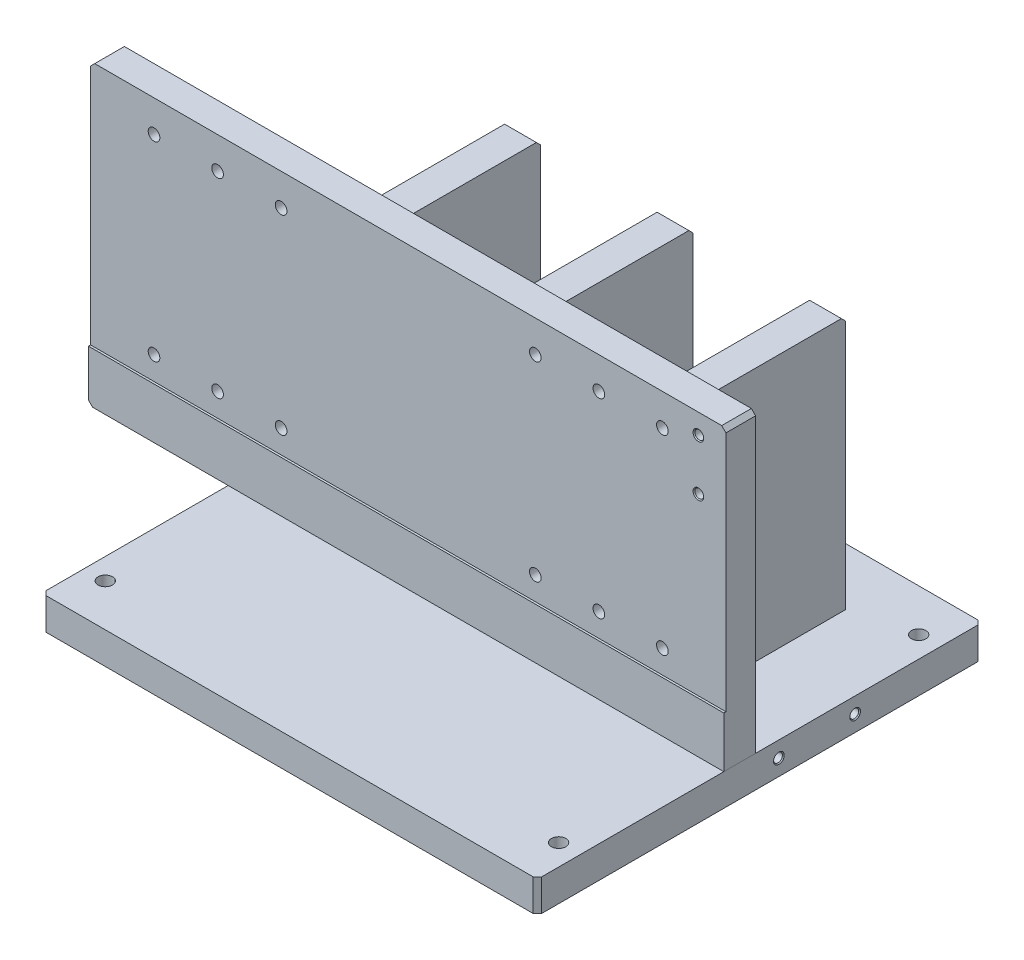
ISO-10303-21;
HEADER;
FILE_DESCRIPTION(('STEP AP214'),'2;1');
FILE_NAME('part.step','',(''),(''),'','','');
FILE_SCHEMA(('AUTOMOTIVE_DESIGN { 1 0 10303 214 1 1 1 1 }'));
ENDSEC;
DATA;
#1=APPLICATION_CONTEXT('core data for automotive mechanical design processes');
#2=APPLICATION_PROTOCOL_DEFINITION('international standard','automotive_design',2000,#1);
#3=PRODUCT_CONTEXT('',#1,'mechanical');
#4=PRODUCT('Part','Part','',(#3));
#5=PRODUCT_RELATED_PRODUCT_CATEGORY('part','',(#4));
#6=PRODUCT_DEFINITION_FORMATION('','',#4);
#7=PRODUCT_DEFINITION_CONTEXT('part definition',#1,'design');
#8=PRODUCT_DEFINITION('design','',#6,#7);
#9=PRODUCT_DEFINITION_SHAPE('','',#8);
#10=(LENGTH_UNIT() NAMED_UNIT(*) SI_UNIT(.MILLI.,.METRE.));
#11=(NAMED_UNIT(*) PLANE_ANGLE_UNIT() SI_UNIT($,.RADIAN.));
#12=(NAMED_UNIT(*) SI_UNIT($,.STERADIAN.) SOLID_ANGLE_UNIT());
#13=UNCERTAINTY_MEASURE_WITH_UNIT(LENGTH_MEASURE(1.E-05),#10,'distance_accuracy_value','');
#14=(GEOMETRIC_REPRESENTATION_CONTEXT(3) GLOBAL_UNCERTAINTY_ASSIGNED_CONTEXT((#13)) GLOBAL_UNIT_ASSIGNED_CONTEXT((#10,
#11,#12)) REPRESENTATION_CONTEXT('',''));
#15=CARTESIAN_POINT('',(0.,0.,0.));
#16=DIRECTION('',(0.,0.,1.));
#17=DIRECTION('',(1.,0.,0.));
#18=AXIS2_PLACEMENT_3D('',#15,#16,#17);
#19=CARTESIAN_POINT('',(64.5,135.,2.00000000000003));
#20=DIRECTION('',(1.,0.,0.));
#21=DIRECTION('',(0.,0.,-1.));
#22=AXIS2_PLACEMENT_3D('',#19,#20,#21);
#23=PLANE('',#22);
#24=DIRECTION('',(0.,0.,1.));
#25=VECTOR('',#24,1.);
#26=CARTESIAN_POINT('',(64.5,135.,2.00000000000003));
#27=LINE('',#26,#25);
#28=CARTESIAN_POINT('',(64.5,135.,-76.));
#29=VERTEX_POINT('',#28);
#30=CARTESIAN_POINT('',(64.5,135.,2.00000000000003));
#31=VERTEX_POINT('',#30);
#32=EDGE_CURVE('E106',#29,#31,#27,.T.);
#33=ORIENTED_EDGE('',*,*,#32,.F.);
#34=DIRECTION('',(0.,-0.707106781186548,-0.707106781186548));
#35=VECTOR('',#34,1.);
#36=CARTESIAN_POINT('',(64.5,174.,-37.));
#37=LINE('',#36,#35);
#38=CARTESIAN_POINT('',(64.5,133.,-78.));
#39=VERTEX_POINT('',#38);
#40=EDGE_CURVE('E60',#29,#39,#37,.T.);
#41=ORIENTED_EDGE('',*,*,#40,.T.);
#42=DIRECTION('',(0.,-1.,0.));
#43=VECTOR('',#42,1.);
#44=CARTESIAN_POINT('',(64.5,135.,-78.));
#45=LINE('',#44,#43);
#46=CARTESIAN_POINT('',(64.5,15.,-78.));
#47=VERTEX_POINT('',#46);
#48=EDGE_CURVE('E87',#39,#47,#45,.T.);
#49=ORIENTED_EDGE('',*,*,#48,.T.);
#50=DIRECTION('',(0.,0.,1.));
#51=VECTOR('',#50,1.);
#52=CARTESIAN_POINT('',(64.5,15.,2.00000000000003));
#53=LINE('',#52,#51);
#54=CARTESIAN_POINT('',(64.5,15.,2.00000000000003));
#55=VERTEX_POINT('',#54);
#56=EDGE_CURVE('E92',#47,#55,#53,.T.);
#57=ORIENTED_EDGE('',*,*,#56,.T.);
#58=DIRECTION('',(0.,-1.,0.));
#59=VECTOR('',#58,1.);
#60=CARTESIAN_POINT('',(64.5,135.,2.00000000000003));
#61=LINE('',#60,#59);
#62=EDGE_CURVE('E53',#31,#55,#61,.T.);
#63=ORIENTED_EDGE('',*,*,#62,.F.);
#64=EDGE_LOOP('',(#33,#41,#49,#57,#63));
#65=FACE_BOUND('',#64,.T.);
#66=ADVANCED_FACE('F46',(#65),#23,.F.);
#67=CARTESIAN_POINT('',(64.5,135.,2.00000000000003));
#68=DIRECTION('',(0.,0.,-1.));
#69=DIRECTION('',(-1.,0.,0.));
#70=AXIS2_PLACEMENT_3D('',#67,#68,#69);
#71=PLANE('',#70);
#72=DIRECTION('',(1.,0.,0.));
#73=VECTOR('',#72,1.);
#74=CARTESIAN_POINT('',(64.5,15.,2.00000000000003));
#75=LINE('',#74,#73);
#76=CARTESIAN_POINT('',(79.5,15.,2.00000000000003));
#77=VERTEX_POINT('',#76);
#78=EDGE_CURVE('E110',#55,#77,#75,.T.);
#79=ORIENTED_EDGE('',*,*,#78,.T.);
#80=DIRECTION('',(0.,-1.,0.));
#81=VECTOR('',#80,1.);
#82=CARTESIAN_POINT('',(79.5,135.,2.00000000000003));
#83=LINE('',#82,#81);
#84=CARTESIAN_POINT('',(79.5,135.,2.00000000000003));
#85=VERTEX_POINT('',#84);
#86=EDGE_CURVE('E121',#85,#77,#83,.T.);
#87=ORIENTED_EDGE('',*,*,#86,.F.);
#88=DIRECTION('',(1.,0.,0.));
#89=VECTOR('',#88,1.);
#90=CARTESIAN_POINT('',(64.5,135.,2.00000000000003));
#91=LINE('',#90,#89);
#92=EDGE_CURVE('E68',#31,#85,#91,.T.);
#93=ORIENTED_EDGE('',*,*,#92,.F.);
#94=ORIENTED_EDGE('',*,*,#62,.T.);
#95=EDGE_LOOP('',(#79,#87,#93,#94));
#96=FACE_BOUND('',#95,.T.);
#97=ADVANCED_FACE('F124',(#96),#71,.F.);
#98=CARTESIAN_POINT('',(79.5,135.,2.00000000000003));
#99=DIRECTION('',(-1.,0.,0.));
#100=DIRECTION('',(0.,0.,1.));
#101=AXIS2_PLACEMENT_3D('',#98,#99,#100);
#102=PLANE('',#101);
#103=DIRECTION('',(0.,-1.,0.));
#104=VECTOR('',#103,1.);
#105=CARTESIAN_POINT('',(79.5,135.,-78.));
#106=LINE('',#105,#104);
#107=CARTESIAN_POINT('',(79.5,133.,-78.));
#108=VERTEX_POINT('',#107);
#109=CARTESIAN_POINT('',(79.5,15.,-78.));
#110=VERTEX_POINT('',#109);
#111=EDGE_CURVE('E96',#108,#110,#106,.T.);
#112=ORIENTED_EDGE('',*,*,#111,.F.);
#113=DIRECTION('',(0.,0.707106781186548,0.707106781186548));
#114=VECTOR('',#113,1.);
#115=CARTESIAN_POINT('',(79.5,174.,-37.));
#116=LINE('',#115,#114);
#117=CARTESIAN_POINT('',(79.5,135.,-76.));
#118=VERTEX_POINT('',#117);
#119=EDGE_CURVE('E114',#108,#118,#116,.T.);
#120=ORIENTED_EDGE('',*,*,#119,.T.);
#121=DIRECTION('',(0.,0.,-1.));
#122=VECTOR('',#121,1.);
#123=CARTESIAN_POINT('',(79.5,135.,2.00000000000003));
#124=LINE('',#123,#122);
#125=EDGE_CURVE('E97',#85,#118,#124,.T.);
#126=ORIENTED_EDGE('',*,*,#125,.F.);
#127=ORIENTED_EDGE('',*,*,#86,.T.);
#128=DIRECTION('',(0.,0.,-1.));
#129=VECTOR('',#128,1.);
#130=CARTESIAN_POINT('',(79.5,15.,2.00000000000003));
#131=LINE('',#130,#129);
#132=EDGE_CURVE('E107',#77,#110,#131,.T.);
#133=ORIENTED_EDGE('',*,*,#132,.T.);
#134=EDGE_LOOP('',(#112,#120,#126,#127,#133));
#135=FACE_BOUND('',#134,.T.);
#136=ADVANCED_FACE('F136',(#135),#102,.F.);
#137=CARTESIAN_POINT('',(64.5,135.,-78.));
#138=DIRECTION('',(0.,0.,1.));
#139=DIRECTION('',(1.,0.,0.));
#140=AXIS2_PLACEMENT_3D('',#137,#138,#139);
#141=PLANE('',#140);
#142=ORIENTED_EDGE('',*,*,#48,.F.);
#143=DIRECTION('',(-1.,0.,0.));
#144=VECTOR('',#143,1.);
#145=CARTESIAN_POINT('',(117.,133.,-78.));
#146=LINE('',#145,#144);
#147=EDGE_CURVE('E129',#108,#39,#146,.T.);
#148=ORIENTED_EDGE('',*,*,#147,.F.);
#149=ORIENTED_EDGE('',*,*,#111,.T.);
#150=DIRECTION('',(-1.,0.,0.));
#151=VECTOR('',#150,1.);
#152=CARTESIAN_POINT('',(64.5,15.,-78.));
#153=LINE('',#152,#151);
#154=EDGE_CURVE('E100',#110,#47,#153,.T.);
#155=ORIENTED_EDGE('',*,*,#154,.T.);
#156=EDGE_LOOP('',(#142,#148,#149,#155));
#157=FACE_BOUND('',#156,.T.);
#158=ADVANCED_FACE('F101',(#157),#141,.F.);
#159=CARTESIAN_POINT('',(0.,135.,0.));
#160=DIRECTION('',(0.,-1.,0.));
#161=DIRECTION('',(0.,0.,-1.));
#162=AXIS2_PLACEMENT_3D('',#159,#160,#161);
#163=PLANE('',#162);
#164=ORIENTED_EDGE('',*,*,#125,.T.);
#165=DIRECTION('',(-1.,0.,0.));
#166=VECTOR('',#165,1.);
#167=CARTESIAN_POINT('',(0.,135.,-76.));
#168=LINE('',#167,#166);
#169=EDGE_CURVE('E12',#118,#29,#168,.T.);
#170=ORIENTED_EDGE('',*,*,#169,.T.);
#171=ORIENTED_EDGE('',*,*,#32,.T.);
#172=ORIENTED_EDGE('',*,*,#92,.T.);
#173=EDGE_LOOP('',(#164,#170,#171,#172));
#174=FACE_BOUND('',#173,.T.);
#175=ADVANCED_FACE('F138',(#174),#163,.F.);
#176=CARTESIAN_POINT('',(0.,15.,0.));
#177=DIRECTION('',(0.,-1.,0.));
#178=DIRECTION('',(0.,0.,-1.));
#179=AXIS2_PLACEMENT_3D('',#176,#177,#178);
#180=PLANE('',#179);
#181=ORIENTED_EDGE('',*,*,#56,.F.);
#182=ORIENTED_EDGE('',*,*,#154,.F.);
#183=ORIENTED_EDGE('',*,*,#132,.F.);
#184=ORIENTED_EDGE('',*,*,#78,.F.);
#185=EDGE_LOOP('',(#181,#182,#183,#184));
#186=FACE_BOUND('',#185,.T.);
#187=ADVANCED_FACE('F109',(#186),#180,.T.);
#188=CARTESIAN_POINT('',(117.,133.,-78.));
#189=DIRECTION('',(0.,-0.707106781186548,0.707106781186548));
#190=DIRECTION('',(0.,-0.707106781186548,-0.707106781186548));
#191=AXIS2_PLACEMENT_3D('',#188,#189,#190);
#192=PLANE('',#191);
#193=ORIENTED_EDGE('',*,*,#169,.F.);
#194=ORIENTED_EDGE('',*,*,#119,.F.);
#195=ORIENTED_EDGE('',*,*,#147,.T.);
#196=ORIENTED_EDGE('',*,*,#40,.F.);
#197=EDGE_LOOP('',(#193,#194,#195,#196));
#198=FACE_BOUND('',#197,.T.);
#199=ADVANCED_FACE('F131',(#198),#192,.F.);
#200=CLOSED_SHELL('',(#66,#97,#136,#158,#175,#187,#199));
#201=MANIFOLD_SOLID_BREP('B2',#200);
#202=CARTESIAN_POINT('',(-7.50000000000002,135.,2.00000000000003));
#203=DIRECTION('',(1.,0.,0.));
#204=DIRECTION('',(0.,0.,-1.));
#205=AXIS2_PLACEMENT_3D('',#202,#203,#204);
#206=PLANE('',#205);
#207=DIRECTION('',(0.,0.,1.));
#208=VECTOR('',#207,1.);
#209=CARTESIAN_POINT('',(-7.50000000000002,135.,2.00000000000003));
#210=LINE('',#209,#208);
#211=CARTESIAN_POINT('',(-7.50000000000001,135.,-76.));
#212=VERTEX_POINT('',#211);
#213=CARTESIAN_POINT('',(-7.50000000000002,135.,2.00000000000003));
#214=VERTEX_POINT('',#213);
#215=EDGE_CURVE('E266',#212,#214,#210,.T.);
#216=ORIENTED_EDGE('',*,*,#215,.F.);
#217=DIRECTION('',(0.,-0.707106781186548,-0.707106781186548));
#218=VECTOR('',#217,1.);
#219=CARTESIAN_POINT('',(-7.50000000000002,174.,-37.));
#220=LINE('',#219,#218);
#221=CARTESIAN_POINT('',(-7.50000000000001,133.,-78.));
#222=VERTEX_POINT('',#221);
#223=EDGE_CURVE('E220',#212,#222,#220,.T.);
#224=ORIENTED_EDGE('',*,*,#223,.T.);
#225=DIRECTION('',(0.,-1.,0.));
#226=VECTOR('',#225,1.);
#227=CARTESIAN_POINT('',(-7.50000000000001,135.,-78.));
#228=LINE('',#227,#226);
#229=CARTESIAN_POINT('',(-7.50000000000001,15.,-78.));
#230=VERTEX_POINT('',#229);
#231=EDGE_CURVE('E247',#222,#230,#228,.T.);
#232=ORIENTED_EDGE('',*,*,#231,.T.);
#233=DIRECTION('',(0.,0.,1.));
#234=VECTOR('',#233,1.);
#235=CARTESIAN_POINT('',(-7.50000000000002,15.,2.00000000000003));
#236=LINE('',#235,#234);
#237=CARTESIAN_POINT('',(-7.50000000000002,15.,2.00000000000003));
#238=VERTEX_POINT('',#237);
#239=EDGE_CURVE('E252',#230,#238,#236,.T.);
#240=ORIENTED_EDGE('',*,*,#239,.T.);
#241=DIRECTION('',(0.,-1.,0.));
#242=VECTOR('',#241,1.);
#243=CARTESIAN_POINT('',(-7.50000000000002,135.,2.00000000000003));
#244=LINE('',#243,#242);
#245=EDGE_CURVE('E213',#214,#238,#244,.T.);
#246=ORIENTED_EDGE('',*,*,#245,.F.);
#247=EDGE_LOOP('',(#216,#224,#232,#240,#246));
#248=FACE_BOUND('',#247,.T.);
#249=ADVANCED_FACE('F206',(#248),#206,.F.);
#250=CARTESIAN_POINT('',(-7.50000000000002,135.,2.00000000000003));
#251=DIRECTION('',(0.,0.,-1.));
#252=DIRECTION('',(-1.,0.,0.));
#253=AXIS2_PLACEMENT_3D('',#250,#251,#252);
#254=PLANE('',#253);
#255=DIRECTION('',(1.,0.,0.));
#256=VECTOR('',#255,1.);
#257=CARTESIAN_POINT('',(-7.50000000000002,15.,2.00000000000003));
#258=LINE('',#257,#256);
#259=CARTESIAN_POINT('',(7.49999999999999,15.,2.00000000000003));
#260=VERTEX_POINT('',#259);
#261=EDGE_CURVE('E270',#238,#260,#258,.T.);
#262=ORIENTED_EDGE('',*,*,#261,.T.);
#263=DIRECTION('',(0.,-1.,0.));
#264=VECTOR('',#263,1.);
#265=CARTESIAN_POINT('',(7.49999999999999,135.,2.00000000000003));
#266=LINE('',#265,#264);
#267=CARTESIAN_POINT('',(7.49999999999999,135.,2.00000000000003));
#268=VERTEX_POINT('',#267);
#269=EDGE_CURVE('E281',#268,#260,#266,.T.);
#270=ORIENTED_EDGE('',*,*,#269,.F.);
#271=DIRECTION('',(1.,0.,0.));
#272=VECTOR('',#271,1.);
#273=CARTESIAN_POINT('',(-7.50000000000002,135.,2.00000000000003));
#274=LINE('',#273,#272);
#275=EDGE_CURVE('E228',#214,#268,#274,.T.);
#276=ORIENTED_EDGE('',*,*,#275,.F.);
#277=ORIENTED_EDGE('',*,*,#245,.T.);
#278=EDGE_LOOP('',(#262,#270,#276,#277));
#279=FACE_BOUND('',#278,.T.);
#280=ADVANCED_FACE('F284',(#279),#254,.F.);
#281=CARTESIAN_POINT('',(7.49999999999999,135.,2.00000000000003));
#282=DIRECTION('',(-1.,0.,0.));
#283=DIRECTION('',(0.,0.,1.));
#284=AXIS2_PLACEMENT_3D('',#281,#282,#283);
#285=PLANE('',#284);
#286=DIRECTION('',(0.,-1.,0.));
#287=VECTOR('',#286,1.);
#288=CARTESIAN_POINT('',(7.49999999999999,135.,-78.));
#289=LINE('',#288,#287);
#290=CARTESIAN_POINT('',(7.49999999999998,133.,-78.));
#291=VERTEX_POINT('',#290);
#292=CARTESIAN_POINT('',(7.49999999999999,15.,-78.));
#293=VERTEX_POINT('',#292);
#294=EDGE_CURVE('E256',#291,#293,#289,.T.);
#295=ORIENTED_EDGE('',*,*,#294,.F.);
#296=DIRECTION('',(0.,0.707106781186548,0.707106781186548));
#297=VECTOR('',#296,1.);
#298=CARTESIAN_POINT('',(7.49999999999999,174.,-37.));
#299=LINE('',#298,#297);
#300=CARTESIAN_POINT('',(7.49999999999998,135.,-76.));
#301=VERTEX_POINT('',#300);
#302=EDGE_CURVE('E274',#291,#301,#299,.T.);
#303=ORIENTED_EDGE('',*,*,#302,.T.);
#304=DIRECTION('',(0.,0.,-1.));
#305=VECTOR('',#304,1.);
#306=CARTESIAN_POINT('',(7.49999999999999,135.,2.00000000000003));
#307=LINE('',#306,#305);
#308=EDGE_CURVE('E257',#268,#301,#307,.T.);
#309=ORIENTED_EDGE('',*,*,#308,.F.);
#310=ORIENTED_EDGE('',*,*,#269,.T.);
#311=DIRECTION('',(0.,0.,-1.));
#312=VECTOR('',#311,1.);
#313=CARTESIAN_POINT('',(7.49999999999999,15.,2.00000000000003));
#314=LINE('',#313,#312);
#315=EDGE_CURVE('E267',#260,#293,#314,.T.);
#316=ORIENTED_EDGE('',*,*,#315,.T.);
#317=EDGE_LOOP('',(#295,#303,#309,#310,#316));
#318=FACE_BOUND('',#317,.T.);
#319=ADVANCED_FACE('F296',(#318),#285,.F.);
#320=CARTESIAN_POINT('',(-7.50000000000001,135.,-78.));
#321=DIRECTION('',(0.,0.,1.));
#322=DIRECTION('',(1.,0.,0.));
#323=AXIS2_PLACEMENT_3D('',#320,#321,#322);
#324=PLANE('',#323);
#325=ORIENTED_EDGE('',*,*,#231,.F.);
#326=DIRECTION('',(-1.,0.,0.));
#327=VECTOR('',#326,1.);
#328=CARTESIAN_POINT('',(117.,133.,-78.));
#329=LINE('',#328,#327);
#330=EDGE_CURVE('E289',#291,#222,#329,.T.);
#331=ORIENTED_EDGE('',*,*,#330,.F.);
#332=ORIENTED_EDGE('',*,*,#294,.T.);
#333=DIRECTION('',(-1.,0.,0.));
#334=VECTOR('',#333,1.);
#335=CARTESIAN_POINT('',(-7.50000000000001,15.,-78.));
#336=LINE('',#335,#334);
#337=EDGE_CURVE('E260',#293,#230,#336,.T.);
#338=ORIENTED_EDGE('',*,*,#337,.T.);
#339=EDGE_LOOP('',(#325,#331,#332,#338));
#340=FACE_BOUND('',#339,.T.);
#341=ADVANCED_FACE('F261',(#340),#324,.F.);
#342=CARTESIAN_POINT('',(0.,135.,0.));
#343=DIRECTION('',(0.,-1.,0.));
#344=DIRECTION('',(0.,0.,-1.));
#345=AXIS2_PLACEMENT_3D('',#342,#343,#344);
#346=PLANE('',#345);
#347=ORIENTED_EDGE('',*,*,#308,.T.);
#348=DIRECTION('',(-1.,0.,0.));
#349=VECTOR('',#348,1.);
#350=CARTESIAN_POINT('',(0.,135.,-76.));
#351=LINE('',#350,#349);
#352=EDGE_CURVE('E44',#301,#212,#351,.T.);
#353=ORIENTED_EDGE('',*,*,#352,.T.);
#354=ORIENTED_EDGE('',*,*,#215,.T.);
#355=ORIENTED_EDGE('',*,*,#275,.T.);
#356=EDGE_LOOP('',(#347,#353,#354,#355));
#357=FACE_BOUND('',#356,.T.);
#358=ADVANCED_FACE('F298',(#357),#346,.F.);
#359=CARTESIAN_POINT('',(0.,15.,0.));
#360=DIRECTION('',(0.,-1.,0.));
#361=DIRECTION('',(0.,0.,-1.));
#362=AXIS2_PLACEMENT_3D('',#359,#360,#361);
#363=PLANE('',#362);
#364=ORIENTED_EDGE('',*,*,#239,.F.);
#365=ORIENTED_EDGE('',*,*,#337,.F.);
#366=ORIENTED_EDGE('',*,*,#315,.F.);
#367=ORIENTED_EDGE('',*,*,#261,.F.);
#368=EDGE_LOOP('',(#364,#365,#366,#367));
#369=FACE_BOUND('',#368,.T.);
#370=ADVANCED_FACE('F269',(#369),#363,.T.);
#371=CARTESIAN_POINT('',(117.,133.,-78.));
#372=DIRECTION('',(0.,-0.707106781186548,0.707106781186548));
#373=DIRECTION('',(0.,-0.707106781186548,-0.707106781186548));
#374=AXIS2_PLACEMENT_3D('',#371,#372,#373);
#375=PLANE('',#374);
#376=ORIENTED_EDGE('',*,*,#352,.F.);
#377=ORIENTED_EDGE('',*,*,#302,.F.);
#378=ORIENTED_EDGE('',*,*,#330,.T.);
#379=ORIENTED_EDGE('',*,*,#223,.F.);
#380=EDGE_LOOP('',(#376,#377,#378,#379));
#381=FACE_BOUND('',#380,.T.);
#382=ADVANCED_FACE('F291',(#381),#375,.F.);
#383=CLOSED_SHELL('',(#249,#280,#319,#341,#358,#370,#382));
#384=MANIFOLD_SOLID_BREP('B6',#383);
#385=CARTESIAN_POINT('',(-79.5,135.,2.00000000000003));
#386=DIRECTION('',(1.,0.,0.));
#387=DIRECTION('',(0.,0.,-1.));
#388=AXIS2_PLACEMENT_3D('',#385,#386,#387);
#389=PLANE('',#388);
#390=DIRECTION('',(0.,0.,1.));
#391=VECTOR('',#390,1.);
#392=CARTESIAN_POINT('',(-79.5,135.,2.00000000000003));
#393=LINE('',#392,#391);
#394=CARTESIAN_POINT('',(-79.5,135.,-76.));
#395=VERTEX_POINT('',#394);
#396=CARTESIAN_POINT('',(-79.5,135.,2.00000000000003));
#397=VERTEX_POINT('',#396);
#398=EDGE_CURVE('E426',#395,#397,#393,.T.);
#399=ORIENTED_EDGE('',*,*,#398,.F.);
#400=DIRECTION('',(0.,0.707106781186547,0.707106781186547));
#401=VECTOR('',#400,1.);
#402=CARTESIAN_POINT('',(-79.5,133.,-78.));
#403=LINE('',#402,#401);
#404=CARTESIAN_POINT('',(-79.5,133.,-78.));
#405=VERTEX_POINT('',#404);
#406=EDGE_CURVE('E380',#405,#395,#403,.T.);
#407=ORIENTED_EDGE('',*,*,#406,.F.);
#408=DIRECTION('',(0.,-1.,0.));
#409=VECTOR('',#408,1.);
#410=CARTESIAN_POINT('',(-79.5,135.,-78.));
#411=LINE('',#410,#409);
#412=CARTESIAN_POINT('',(-79.5,15.,-78.));
#413=VERTEX_POINT('',#412);
#414=EDGE_CURVE('E407',#405,#413,#411,.T.);
#415=ORIENTED_EDGE('',*,*,#414,.T.);
#416=DIRECTION('',(0.,0.,1.));
#417=VECTOR('',#416,1.);
#418=CARTESIAN_POINT('',(-79.5,15.,2.00000000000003));
#419=LINE('',#418,#417);
#420=CARTESIAN_POINT('',(-79.5,15.,2.00000000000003));
#421=VERTEX_POINT('',#420);
#422=EDGE_CURVE('E412',#413,#421,#419,.T.);
#423=ORIENTED_EDGE('',*,*,#422,.T.);
#424=DIRECTION('',(0.,-1.,0.));
#425=VECTOR('',#424,1.);
#426=CARTESIAN_POINT('',(-79.5,135.,2.00000000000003));
#427=LINE('',#426,#425);
#428=EDGE_CURVE('E373',#397,#421,#427,.T.);
#429=ORIENTED_EDGE('',*,*,#428,.F.);
#430=EDGE_LOOP('',(#399,#407,#415,#423,#429));
#431=FACE_BOUND('',#430,.T.);
#432=ADVANCED_FACE('F366',(#431),#389,.F.);
#433=CARTESIAN_POINT('',(-79.5,135.,2.00000000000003));
#434=DIRECTION('',(0.,0.,-1.));
#435=DIRECTION('',(-1.,0.,0.));
#436=AXIS2_PLACEMENT_3D('',#433,#434,#435);
#437=PLANE('',#436);
#438=DIRECTION('',(1.,0.,0.));
#439=VECTOR('',#438,1.);
#440=CARTESIAN_POINT('',(-79.5,15.,2.00000000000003));
#441=LINE('',#440,#439);
#442=CARTESIAN_POINT('',(-64.5,15.,2.00000000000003));
#443=VERTEX_POINT('',#442);
#444=EDGE_CURVE('E430',#421,#443,#441,.T.);
#445=ORIENTED_EDGE('',*,*,#444,.T.);
#446=DIRECTION('',(0.,-1.,0.));
#447=VECTOR('',#446,1.);
#448=CARTESIAN_POINT('',(-64.5,135.,2.00000000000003));
#449=LINE('',#448,#447);
#450=CARTESIAN_POINT('',(-64.5,135.,2.00000000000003));
#451=VERTEX_POINT('',#450);
#452=EDGE_CURVE('E443',#451,#443,#449,.T.);
#453=ORIENTED_EDGE('',*,*,#452,.F.);
#454=DIRECTION('',(1.,0.,0.));
#455=VECTOR('',#454,1.);
#456=CARTESIAN_POINT('',(-79.5,135.,2.00000000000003));
#457=LINE('',#456,#455);
#458=EDGE_CURVE('E388',#397,#451,#457,.T.);
#459=ORIENTED_EDGE('',*,*,#458,.F.);
#460=ORIENTED_EDGE('',*,*,#428,.T.);
#461=EDGE_LOOP('',(#445,#453,#459,#460));
#462=FACE_BOUND('',#461,.T.);
#463=ADVANCED_FACE('F446',(#462),#437,.F.);
#464=CARTESIAN_POINT('',(-64.5,135.,2.00000000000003));
#465=DIRECTION('',(-1.,0.,0.));
#466=DIRECTION('',(0.,0.,1.));
#467=AXIS2_PLACEMENT_3D('',#464,#465,#466);
#468=PLANE('',#467);
#469=DIRECTION('',(0.,-1.,0.));
#470=VECTOR('',#469,1.);
#471=CARTESIAN_POINT('',(-64.5,135.,-78.));
#472=LINE('',#471,#470);
#473=CARTESIAN_POINT('',(-64.5,133.,-78.));
#474=VERTEX_POINT('',#473);
#475=CARTESIAN_POINT('',(-64.5,15.,-78.));
#476=VERTEX_POINT('',#475);
#477=EDGE_CURVE('E416',#474,#476,#472,.T.);
#478=ORIENTED_EDGE('',*,*,#477,.F.);
#479=DIRECTION('',(0.,0.707106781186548,0.707106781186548));
#480=VECTOR('',#479,1.);
#481=CARTESIAN_POINT('',(-64.5,174.,-37.));
#482=LINE('',#481,#480);
#483=CARTESIAN_POINT('',(-64.5,135.,-76.));
#484=VERTEX_POINT('',#483);
#485=EDGE_CURVE('E432',#474,#484,#482,.T.);
#486=ORIENTED_EDGE('',*,*,#485,.T.);
#487=DIRECTION('',(0.,0.,-1.));
#488=VECTOR('',#487,1.);
#489=CARTESIAN_POINT('',(-64.5,135.,2.00000000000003));
#490=LINE('',#489,#488);
#491=EDGE_CURVE('E417',#451,#484,#490,.T.);
#492=ORIENTED_EDGE('',*,*,#491,.F.);
#493=ORIENTED_EDGE('',*,*,#452,.T.);
#494=DIRECTION('',(0.,0.,-1.));
#495=VECTOR('',#494,1.);
#496=CARTESIAN_POINT('',(-64.5,15.,2.00000000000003));
#497=LINE('',#496,#495);
#498=EDGE_CURVE('E427',#443,#476,#497,.T.);
#499=ORIENTED_EDGE('',*,*,#498,.T.);
#500=EDGE_LOOP('',(#478,#486,#492,#493,#499));
#501=FACE_BOUND('',#500,.T.);
#502=ADVANCED_FACE('F456',(#501),#468,.F.);
#503=CARTESIAN_POINT('',(-79.5,135.,-78.));
#504=DIRECTION('',(0.,0.,1.));
#505=DIRECTION('',(1.,0.,0.));
#506=AXIS2_PLACEMENT_3D('',#503,#504,#505);
#507=PLANE('',#506);
#508=ORIENTED_EDGE('',*,*,#414,.F.);
#509=DIRECTION('',(-1.,0.,0.));
#510=VECTOR('',#509,1.);
#511=CARTESIAN_POINT('',(117.,133.,-78.));
#512=LINE('',#511,#510);
#513=EDGE_CURVE('E436',#474,#405,#512,.T.);
#514=ORIENTED_EDGE('',*,*,#513,.F.);
#515=ORIENTED_EDGE('',*,*,#477,.T.);
#516=DIRECTION('',(-1.,0.,0.));
#517=VECTOR('',#516,1.);
#518=CARTESIAN_POINT('',(-79.5,15.,-78.));
#519=LINE('',#518,#517);
#520=EDGE_CURVE('E420',#476,#413,#519,.T.);
#521=ORIENTED_EDGE('',*,*,#520,.T.);
#522=EDGE_LOOP('',(#508,#514,#515,#521));
#523=FACE_BOUND('',#522,.T.);
#524=ADVANCED_FACE('F421',(#523),#507,.F.);
#525=CARTESIAN_POINT('',(0.,135.,0.));
#526=DIRECTION('',(0.,-1.,0.));
#527=DIRECTION('',(0.,0.,-1.));
#528=AXIS2_PLACEMENT_3D('',#525,#526,#527);
#529=PLANE('',#528);
#530=ORIENTED_EDGE('',*,*,#491,.T.);
#531=DIRECTION('',(-1.,0.,0.));
#532=VECTOR('',#531,1.);
#533=CARTESIAN_POINT('',(0.,135.,-76.));
#534=LINE('',#533,#532);
#535=EDGE_CURVE('E204',#484,#395,#534,.T.);
#536=ORIENTED_EDGE('',*,*,#535,.T.);
#537=ORIENTED_EDGE('',*,*,#398,.T.);
#538=ORIENTED_EDGE('',*,*,#458,.T.);
#539=EDGE_LOOP('',(#530,#536,#537,#538));
#540=FACE_BOUND('',#539,.T.);
#541=ADVANCED_FACE('F458',(#540),#529,.F.);
#542=CARTESIAN_POINT('',(0.,15.,0.));
#543=DIRECTION('',(0.,-1.,0.));
#544=DIRECTION('',(0.,0.,-1.));
#545=AXIS2_PLACEMENT_3D('',#542,#543,#544);
#546=PLANE('',#545);
#547=ORIENTED_EDGE('',*,*,#422,.F.);
#548=ORIENTED_EDGE('',*,*,#520,.F.);
#549=ORIENTED_EDGE('',*,*,#498,.F.);
#550=ORIENTED_EDGE('',*,*,#444,.F.);
#551=EDGE_LOOP('',(#547,#548,#549,#550));
#552=FACE_BOUND('',#551,.T.);
#553=ADVANCED_FACE('F429',(#552),#546,.T.);
#554=CARTESIAN_POINT('',(117.,133.,-78.));
#555=DIRECTION('',(0.,-0.707106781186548,0.707106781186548));
#556=DIRECTION('',(0.,-0.707106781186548,-0.707106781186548));
#557=AXIS2_PLACEMENT_3D('',#554,#555,#556);
#558=PLANE('',#557);
#559=ORIENTED_EDGE('',*,*,#513,.T.);
#560=ORIENTED_EDGE('',*,*,#406,.T.);
#561=ORIENTED_EDGE('',*,*,#535,.F.);
#562=ORIENTED_EDGE('',*,*,#485,.F.);
#563=EDGE_LOOP('',(#559,#560,#561,#562));
#564=FACE_BOUND('',#563,.T.);
#565=ADVANCED_FACE('F451',(#564),#558,.F.);
#566=CLOSED_SHELL('',(#432,#463,#502,#524,#541,#553,#565));
#567=MANIFOLD_SOLID_BREP('B38',#566);
#568=CARTESIAN_POINT('',(0.,155.,0.));
#569=DIRECTION('',(0.,-1.,0.));
#570=DIRECTION('',(0.,0.,-1.));
#571=AXIS2_PLACEMENT_3D('',#568,#569,#570);
#572=PLANE('',#571);
#573=DIRECTION('',(-1.,0.,0.));
#574=VECTOR('',#573,1.);
#575=CARTESIAN_POINT('',(117.,155.,2.00000000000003));
#576=LINE('',#575,#574);
#577=CARTESIAN_POINT('',(115.,155.,2.00000000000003));
#578=VERTEX_POINT('',#577);
#579=CARTESIAN_POINT('',(-181.,155.,2.00000000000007));
#580=VERTEX_POINT('',#579);
#581=EDGE_CURVE('E626',#578,#580,#576,.T.);
#582=ORIENTED_EDGE('',*,*,#581,.T.);
#583=DIRECTION('',(0.,0.,1.));
#584=VECTOR('',#583,1.);
#585=CARTESIAN_POINT('',(-181.,155.,0.));
#586=LINE('',#585,#584);
#587=CARTESIAN_POINT('',(-181.,155.,16.));
#588=VERTEX_POINT('',#587);
#589=EDGE_CURVE('E700',#580,#588,#586,.T.);
#590=ORIENTED_EDGE('',*,*,#589,.T.);
#591=DIRECTION('',(-1.,0.,0.));
#592=VECTOR('',#591,1.);
#593=CARTESIAN_POINT('',(-183.,155.,16.));
#594=LINE('',#593,#592);
#595=CARTESIAN_POINT('',(115.,155.,16.));
#596=VERTEX_POINT('',#595);
#597=EDGE_CURVE('E619',#596,#588,#594,.T.);
#598=ORIENTED_EDGE('',*,*,#597,.F.);
#599=DIRECTION('',(0.,0.,-1.));
#600=VECTOR('',#599,1.);
#601=CARTESIAN_POINT('',(115.,155.,-1.06396373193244E-13));
#602=LINE('',#601,#600);
#603=EDGE_CURVE('E697',#596,#578,#602,.T.);
#604=ORIENTED_EDGE('',*,*,#603,.T.);
#605=EDGE_LOOP('',(#582,#590,#598,#604));
#606=FACE_BOUND('',#605,.T.);
#607=ADVANCED_FACE('F525',(#606),#572,.F.);
#608=CARTESIAN_POINT('',(117.,155.,2.00000000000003));
#609=DIRECTION('',(-1.,0.,0.));
#610=DIRECTION('',(0.,0.,1.));
#611=AXIS2_PLACEMENT_3D('',#608,#609,#610);
#612=PLANE('',#611);
#613=DIRECTION('',(0.,-1.,0.));
#614=VECTOR('',#613,1.);
#615=CARTESIAN_POINT('',(117.,155.,2.00000000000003));
#616=LINE('',#615,#614);
#617=CARTESIAN_POINT('',(117.,153.,2.00000000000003));
#618=VERTEX_POINT('',#617);
#619=CARTESIAN_POINT('',(117.,15.,2.00000000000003));
#620=VERTEX_POINT('',#619);
#621=EDGE_CURVE('E642',#618,#620,#616,.T.);
#622=ORIENTED_EDGE('',*,*,#621,.F.);
#623=DIRECTION('',(0.,0.,1.));
#624=VECTOR('',#623,1.);
#625=CARTESIAN_POINT('',(117.,153.,2.00000000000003));
#626=LINE('',#625,#624);
#627=CARTESIAN_POINT('',(117.,153.,16.));
#628=VERTEX_POINT('',#627);
#629=EDGE_CURVE('E364',#618,#628,#626,.T.);
#630=ORIENTED_EDGE('',*,*,#629,.T.);
#631=DIRECTION('',(0.,1.,0.));
#632=VECTOR('',#631,1.);
#633=CARTESIAN_POINT('',(117.,155.,16.));
#634=LINE('',#633,#632);
#635=CARTESIAN_POINT('',(117.,39.,16.));
#636=VERTEX_POINT('',#635);
#637=EDGE_CURVE('E611',#636,#628,#634,.T.);
#638=ORIENTED_EDGE('',*,*,#637,.F.);
#639=DIRECTION('',(0.,0.,1.));
#640=VECTOR('',#639,1.);
#641=CARTESIAN_POINT('',(117.,39.,16.));
#642=LINE('',#641,#640);
#643=CARTESIAN_POINT('',(117.,39.,17.));
#644=VERTEX_POINT('',#643);
#645=EDGE_CURVE('E610',#636,#644,#642,.T.);
#646=ORIENTED_EDGE('',*,*,#645,.T.);
#647=DIRECTION('',(0.,-1.,0.));
#648=VECTOR('',#647,1.);
#649=CARTESIAN_POINT('',(117.,155.,17.));
#650=LINE('',#649,#648);
#651=CARTESIAN_POINT('',(117.,15.,17.));
#652=VERTEX_POINT('',#651);
#653=EDGE_CURVE('E629',#644,#652,#650,.T.);
#654=ORIENTED_EDGE('',*,*,#653,.T.);
#655=DIRECTION('',(0.,0.,-1.));
#656=VECTOR('',#655,1.);
#657=CARTESIAN_POINT('',(117.,15.,2.00000000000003));
#658=LINE('',#657,#656);
#659=EDGE_CURVE('E621',#652,#620,#658,.T.);
#660=ORIENTED_EDGE('',*,*,#659,.T.);
#661=EDGE_LOOP('',(#622,#630,#638,#646,#654,#660));
#662=FACE_BOUND('',#661,.T.);
#663=ADVANCED_FACE('F712',(#662),#612,.F.);
#664=CARTESIAN_POINT('',(117.,155.,2.00000000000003));
#665=DIRECTION('',(0.,0.,1.));
#666=DIRECTION('',(1.,0.,0.));
#667=AXIS2_PLACEMENT_3D('',#664,#665,#666);
#668=PLANE('',#667);
#669=CARTESIAN_POINT('',(104.,145.5,2.00000000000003));
#670=DIRECTION('',(0.,0.,1.));
#671=DIRECTION('',(1.,0.,0.));
#672=AXIS2_PLACEMENT_3D('',#669,#670,#671);
#673=CIRCLE('',#672,2.09999999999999);
#674=CARTESIAN_POINT('',(106.1,145.5,2.00000000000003));
#675=VERTEX_POINT('',#674);
#676=EDGE_CURVE('E679',#675,#675,#673,.T.);
#677=ORIENTED_EDGE('',*,*,#676,.T.);
#678=EDGE_LOOP('',(#677));
#679=FACE_BOUND('',#678,.T.);
#680=CARTESIAN_POINT('',(104.,121.5,2.00000000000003));
#681=DIRECTION('',(0.,0.,1.));
#682=DIRECTION('',(1.,0.,0.));
#683=AXIS2_PLACEMENT_3D('',#680,#681,#682);
#684=CIRCLE('',#683,2.09999999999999);
#685=CARTESIAN_POINT('',(106.1,121.5,2.00000000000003));
#686=VERTEX_POINT('',#685);
#687=EDGE_CURVE('E674',#686,#686,#684,.T.);
#688=ORIENTED_EDGE('',*,*,#687,.T.);
#689=EDGE_LOOP('',(#688));
#690=FACE_BOUND('',#689,.T.);
#691=CARTESIAN_POINT('',(-123.,140.,2.00000000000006));
#692=DIRECTION('',(0.,0.,-1.));
#693=DIRECTION('',(-1.,0.,0.));
#694=AXIS2_PLACEMENT_3D('',#691,#692,#693);
#695=CIRCLE('',#694,4.75);
#696=CARTESIAN_POINT('',(-127.75,140.,2.00000000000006));
#697=VERTEX_POINT('',#696);
#698=EDGE_CURVE('E677',#697,#697,#695,.T.);
#699=ORIENTED_EDGE('',*,*,#698,.F.);
#700=EDGE_LOOP('',(#699));
#701=FACE_BOUND('',#700,.T.);
#702=CARTESIAN_POINT('',(-153.,140.,2.00000000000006));
#703=DIRECTION('',(0.,0.,-1.));
#704=DIRECTION('',(-1.,0.,0.));
#705=AXIS2_PLACEMENT_3D('',#702,#703,#704);
#706=CIRCLE('',#705,4.75);
#707=CARTESIAN_POINT('',(-157.75,140.,2.00000000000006));
#708=VERTEX_POINT('',#707);
#709=EDGE_CURVE('E828',#708,#708,#706,.T.);
#710=ORIENTED_EDGE('',*,*,#709,.F.);
#711=EDGE_LOOP('',(#710));
#712=FACE_BOUND('',#711,.T.);
#713=CARTESIAN_POINT('',(-93.,50.,2.00000000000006));
#714=DIRECTION('',(0.,0.,-1.));
#715=DIRECTION('',(-1.,0.,0.));
#716=AXIS2_PLACEMENT_3D('',#713,#714,#715);
#717=CIRCLE('',#716,4.75);
#718=CARTESIAN_POINT('',(-97.75,50.,2.00000000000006));
#719=VERTEX_POINT('',#718);
#720=EDGE_CURVE('E816',#719,#719,#717,.T.);
#721=ORIENTED_EDGE('',*,*,#720,.F.);
#722=EDGE_LOOP('',(#721));
#723=FACE_BOUND('',#722,.T.);
#724=CARTESIAN_POINT('',(-153.,50.,2.00000000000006));
#725=DIRECTION('',(0.,0.,-1.));
#726=DIRECTION('',(-1.,0.,0.));
#727=AXIS2_PLACEMENT_3D('',#724,#725,#726);
#728=CIRCLE('',#727,4.75);
#729=CARTESIAN_POINT('',(-157.75,50.,2.00000000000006));
#730=VERTEX_POINT('',#729);
#731=EDGE_CURVE('E804',#730,#730,#728,.T.);
#732=ORIENTED_EDGE('',*,*,#731,.F.);
#733=EDGE_LOOP('',(#732));
#734=FACE_BOUND('',#733,.T.);
#735=CARTESIAN_POINT('',(-123.,50.,2.00000000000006));
#736=DIRECTION('',(0.,0.,-1.));
#737=DIRECTION('',(-1.,0.,0.));
#738=AXIS2_PLACEMENT_3D('',#735,#736,#737);
#739=CIRCLE('',#738,4.75);
#740=CARTESIAN_POINT('',(-127.75,50.,2.00000000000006));
#741=VERTEX_POINT('',#740);
#742=EDGE_CURVE('E792',#741,#741,#739,.T.);
#743=ORIENTED_EDGE('',*,*,#742,.F.);
#744=EDGE_LOOP('',(#743));
#745=FACE_BOUND('',#744,.T.);
#746=CARTESIAN_POINT('',(-93.,140.,2.00000000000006));
#747=DIRECTION('',(0.,0.,-1.));
#748=DIRECTION('',(-1.,0.,0.));
#749=AXIS2_PLACEMENT_3D('',#746,#747,#748);
#750=CIRCLE('',#749,4.75);
#751=CARTESIAN_POINT('',(-97.75,140.,2.00000000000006));
#752=VERTEX_POINT('',#751);
#753=EDGE_CURVE('E780',#752,#752,#750,.T.);
#754=ORIENTED_EDGE('',*,*,#753,.F.);
#755=EDGE_LOOP('',(#754));
#756=FACE_BOUND('',#755,.T.);
#757=CARTESIAN_POINT('',(87.,140.,2.00000000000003));
#758=DIRECTION('',(0.,0.,-1.));
#759=DIRECTION('',(-1.,0.,0.));
#760=AXIS2_PLACEMENT_3D('',#757,#758,#759);
#761=CIRCLE('',#760,4.75);
#762=CARTESIAN_POINT('',(82.25,140.,2.00000000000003));
#763=VERTEX_POINT('',#762);
#764=EDGE_CURVE('E768',#763,#763,#761,.T.);
#765=ORIENTED_EDGE('',*,*,#764,.F.);
#766=EDGE_LOOP('',(#765));
#767=FACE_BOUND('',#766,.T.);
#768=CARTESIAN_POINT('',(57.,140.,2.00000000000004));
#769=DIRECTION('',(0.,0.,-1.));
#770=DIRECTION('',(-1.,0.,0.));
#771=AXIS2_PLACEMENT_3D('',#768,#769,#770);
#772=CIRCLE('',#771,4.75);
#773=CARTESIAN_POINT('',(52.25,140.,2.00000000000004));
#774=VERTEX_POINT('',#773);
#775=EDGE_CURVE('E672',#774,#774,#772,.T.);
#776=ORIENTED_EDGE('',*,*,#775,.F.);
#777=EDGE_LOOP('',(#776));
#778=FACE_BOUND('',#777,.T.);
#779=CARTESIAN_POINT('',(27.,140.,2.00000000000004));
#780=DIRECTION('',(0.,0.,-1.));
#781=DIRECTION('',(-1.,0.,0.));
#782=AXIS2_PLACEMENT_3D('',#779,#780,#781);
#783=CIRCLE('',#782,4.75);
#784=CARTESIAN_POINT('',(22.25,140.,2.00000000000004));
#785=VERTEX_POINT('',#784);
#786=EDGE_CURVE('E667',#785,#785,#783,.T.);
#787=ORIENTED_EDGE('',*,*,#786,.F.);
#788=EDGE_LOOP('',(#787));
#789=FACE_BOUND('',#788,.T.);
#790=CARTESIAN_POINT('',(87.,50.,2.00000000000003));
#791=DIRECTION('',(0.,0.,-1.));
#792=DIRECTION('',(-1.,0.,0.));
#793=AXIS2_PLACEMENT_3D('',#790,#791,#792);
#794=CIRCLE('',#793,4.75);
#795=CARTESIAN_POINT('',(82.25,50.,2.00000000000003));
#796=VERTEX_POINT('',#795);
#797=EDGE_CURVE('E662',#796,#796,#794,.T.);
#798=ORIENTED_EDGE('',*,*,#797,.F.);
#799=EDGE_LOOP('',(#798));
#800=FACE_BOUND('',#799,.T.);
#801=CARTESIAN_POINT('',(27.,50.,2.00000000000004));
#802=DIRECTION('',(0.,0.,-1.));
#803=DIRECTION('',(-1.,0.,0.));
#804=AXIS2_PLACEMENT_3D('',#801,#802,#803);
#805=CIRCLE('',#804,4.75);
#806=CARTESIAN_POINT('',(22.25,50.,2.00000000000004));
#807=VERTEX_POINT('',#806);
#808=EDGE_CURVE('E657',#807,#807,#805,.T.);
#809=ORIENTED_EDGE('',*,*,#808,.F.);
#810=EDGE_LOOP('',(#809));
#811=FACE_BOUND('',#810,.T.);
#812=CARTESIAN_POINT('',(57.,50.,2.00000000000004));
#813=DIRECTION('',(0.,0.,-1.));
#814=DIRECTION('',(-1.,0.,0.));
#815=AXIS2_PLACEMENT_3D('',#812,#813,#814);
#816=CIRCLE('',#815,4.75);
#817=CARTESIAN_POINT('',(52.25,50.,2.00000000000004));
#818=VERTEX_POINT('',#817);
#819=EDGE_CURVE('E652',#818,#818,#816,.T.);
#820=ORIENTED_EDGE('',*,*,#819,.F.);
#821=EDGE_LOOP('',(#820));
#822=FACE_BOUND('',#821,.T.);
#823=DIRECTION('',(-1.,0.,0.));
#824=VECTOR('',#823,1.);
#825=CARTESIAN_POINT('',(117.,15.,2.00000000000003));
#826=LINE('',#825,#824);
#827=CARTESIAN_POINT('',(-181.,15.,2.00000000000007));
#828=VERTEX_POINT('',#827);
#829=EDGE_CURVE('E633',#620,#828,#826,.T.);
#830=ORIENTED_EDGE('',*,*,#829,.T.);
#831=DIRECTION('',(-0.707106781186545,0.70710678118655,0.));
#832=VECTOR('',#831,1.);
#833=CARTESIAN_POINT('',(-183.,17.,2.00000000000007));
#834=LINE('',#833,#832);
#835=CARTESIAN_POINT('',(-183.,17.,2.00000000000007));
#836=VERTEX_POINT('',#835);
#837=EDGE_CURVE('E695',#828,#836,#834,.T.);
#838=ORIENTED_EDGE('',*,*,#837,.T.);
#839=DIRECTION('',(0.,-1.,0.));
#840=VECTOR('',#839,1.);
#841=CARTESIAN_POINT('',(-183.,155.,2.00000000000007));
#842=LINE('',#841,#840);
#843=CARTESIAN_POINT('',(-183.,153.,2.00000000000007));
#844=VERTEX_POINT('',#843);
#845=EDGE_CURVE('E640',#844,#836,#842,.T.);
#846=ORIENTED_EDGE('',*,*,#845,.F.);
#847=DIRECTION('',(-0.707106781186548,-0.707106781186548,0.));
#848=VECTOR('',#847,1.);
#849=CARTESIAN_POINT('',(-181.,155.,2.00000000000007));
#850=LINE('',#849,#848);
#851=EDGE_CURVE('E693',#844,#580,#850,.F.);
#852=ORIENTED_EDGE('',*,*,#851,.T.);
#853=ORIENTED_EDGE('',*,*,#581,.F.);
#854=DIRECTION('',(-0.707106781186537,0.707106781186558,0.));
#855=VECTOR('',#854,1.);
#856=CARTESIAN_POINT('',(115.,155.,2.00000000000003));
#857=LINE('',#856,#855);
#858=EDGE_CURVE('E691',#578,#618,#857,.F.);
#859=ORIENTED_EDGE('',*,*,#858,.T.);
#860=ORIENTED_EDGE('',*,*,#621,.T.);
#861=EDGE_LOOP('',(#830,#838,#846,#852,#853,#859,#860));
#862=FACE_BOUND('',#861,.T.);
#863=ADVANCED_FACE('F710',(#679,#690,#701,#712,#723,#734,#745,#756,#767,#778,#789,#800,#811,
#822,#862),#668,.F.);
#864=CARTESIAN_POINT('',(-183.,155.,2.00000000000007));
#865=DIRECTION('',(1.,0.,0.));
#866=DIRECTION('',(0.,0.,-1.));
#867=AXIS2_PLACEMENT_3D('',#864,#865,#866);
#868=PLANE('',#867);
#869=ORIENTED_EDGE('',*,*,#845,.T.);
#870=DIRECTION('',(0.,0.,1.));
#871=VECTOR('',#870,1.);
#872=CARTESIAN_POINT('',(-183.,17.,17.0000000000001));
#873=LINE('',#872,#871);
#874=CARTESIAN_POINT('',(-183.,17.,17.0000000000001));
#875=VERTEX_POINT('',#874);
#876=EDGE_CURVE('E685',#836,#875,#873,.T.);
#877=ORIENTED_EDGE('',*,*,#876,.T.);
#878=DIRECTION('',(0.,-1.,0.));
#879=VECTOR('',#878,1.);
#880=CARTESIAN_POINT('',(-183.,155.,17.0000000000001));
#881=LINE('',#880,#879);
#882=CARTESIAN_POINT('',(-183.,39.,17.));
#883=VERTEX_POINT('',#882);
#884=EDGE_CURVE('E618',#883,#875,#881,.T.);
#885=ORIENTED_EDGE('',*,*,#884,.F.);
#886=DIRECTION('',(0.,0.,1.));
#887=VECTOR('',#886,1.);
#888=CARTESIAN_POINT('',(-183.,39.,16.));
#889=LINE('',#888,#887);
#890=CARTESIAN_POINT('',(-183.,39.,16.));
#891=VERTEX_POINT('',#890);
#892=EDGE_CURVE('E607',#891,#883,#889,.T.);
#893=ORIENTED_EDGE('',*,*,#892,.F.);
#894=DIRECTION('',(0.,-1.,0.));
#895=VECTOR('',#894,1.);
#896=CARTESIAN_POINT('',(-183.,155.,16.));
#897=LINE('',#896,#895);
#898=CARTESIAN_POINT('',(-183.,153.,16.));
#899=VERTEX_POINT('',#898);
#900=EDGE_CURVE('E596',#899,#891,#897,.T.);
#901=ORIENTED_EDGE('',*,*,#900,.F.);
#902=DIRECTION('',(0.,0.,-1.));
#903=VECTOR('',#902,1.);
#904=CARTESIAN_POINT('',(-183.,153.,2.00000000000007));
#905=LINE('',#904,#903);
#906=EDGE_CURVE('E644',#899,#844,#905,.T.);
#907=ORIENTED_EDGE('',*,*,#906,.T.);
#908=EDGE_LOOP('',(#869,#877,#885,#893,#901,#907));
#909=FACE_BOUND('',#908,.T.);
#910=ADVANCED_FACE('F615',(#909),#868,.F.);
#911=CARTESIAN_POINT('',(117.,155.,17.));
#912=DIRECTION('',(0.,0.,-1.));
#913=DIRECTION('',(-1.,0.,0.));
#914=AXIS2_PLACEMENT_3D('',#911,#912,#913);
#915=PLANE('',#914);
#916=ORIENTED_EDGE('',*,*,#884,.T.);
#917=DIRECTION('',(0.707106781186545,-0.70710678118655,0.));
#918=VECTOR('',#917,1.);
#919=CARTESIAN_POINT('',(-183.,17.,17.0000000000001));
#920=LINE('',#919,#918);
#921=CARTESIAN_POINT('',(-181.,15.,17.0000000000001));
#922=VERTEX_POINT('',#921);
#923=EDGE_CURVE('E687',#875,#922,#920,.T.);
#924=ORIENTED_EDGE('',*,*,#923,.T.);
#925=DIRECTION('',(1.,0.,0.));
#926=VECTOR('',#925,1.);
#927=CARTESIAN_POINT('',(117.,15.,17.));
#928=LINE('',#927,#926);
#929=EDGE_CURVE('E630',#922,#652,#928,.T.);
#930=ORIENTED_EDGE('',*,*,#929,.T.);
#931=ORIENTED_EDGE('',*,*,#653,.F.);
#932=DIRECTION('',(1.,0.,0.));
#933=VECTOR('',#932,1.);
#934=CARTESIAN_POINT('',(-183.,39.,17.));
#935=LINE('',#934,#933);
#936=EDGE_CURVE('E603',#883,#644,#935,.T.);
#937=ORIENTED_EDGE('',*,*,#936,.F.);
#938=EDGE_LOOP('',(#916,#924,#930,#931,#937));
#939=FACE_BOUND('',#938,.T.);
#940=ADVANCED_FACE('F725',(#939),#915,.F.);
#941=CARTESIAN_POINT('',(0.,15.,0.));
#942=DIRECTION('',(0.,-1.,0.));
#943=DIRECTION('',(0.,0.,-1.));
#944=AXIS2_PLACEMENT_3D('',#941,#942,#943);
#945=PLANE('',#944);
#946=ORIENTED_EDGE('',*,*,#929,.F.);
#947=DIRECTION('',(0.,0.,-1.));
#948=VECTOR('',#947,1.);
#949=CARTESIAN_POINT('',(-181.,15.,2.00000000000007));
#950=LINE('',#949,#948);
#951=EDGE_CURVE('E689',#922,#828,#950,.T.);
#952=ORIENTED_EDGE('',*,*,#951,.T.);
#953=ORIENTED_EDGE('',*,*,#829,.F.);
#954=ORIENTED_EDGE('',*,*,#659,.F.);
#955=EDGE_LOOP('',(#946,#952,#953,#954));
#956=FACE_BOUND('',#955,.T.);
#957=ADVANCED_FACE('F717',(#956),#945,.T.);
#958=CARTESIAN_POINT('',(-183.,39.,16.));
#959=DIRECTION('',(0.,-1.,0.));
#960=DIRECTION('',(0.,0.,-1.));
#961=AXIS2_PLACEMENT_3D('',#958,#959,#960);
#962=PLANE('',#961);
#963=ORIENTED_EDGE('',*,*,#936,.T.);
#964=ORIENTED_EDGE('',*,*,#645,.F.);
#965=DIRECTION('',(1.,0.,0.));
#966=VECTOR('',#965,1.);
#967=CARTESIAN_POINT('',(-183.,39.,16.));
#968=LINE('',#967,#966);
#969=EDGE_CURVE('E600',#891,#636,#968,.T.);
#970=ORIENTED_EDGE('',*,*,#969,.F.);
#971=ORIENTED_EDGE('',*,*,#892,.T.);
#972=EDGE_LOOP('',(#963,#964,#970,#971));
#973=FACE_BOUND('',#972,.T.);
#974=ADVANCED_FACE('F606',(#973),#962,.F.);
#975=CARTESIAN_POINT('',(0.,0.,16.));
#976=DIRECTION('',(0.,0.,1.));
#977=DIRECTION('',(1.,0.,0.));
#978=AXIS2_PLACEMENT_3D('',#975,#976,#977);
#979=PLANE('',#978);
#980=CARTESIAN_POINT('',(104.,145.5,16.));
#981=DIRECTION('',(0.,0.,1.));
#982=DIRECTION('',(1.,0.,0.));
#983=AXIS2_PLACEMENT_3D('',#980,#981,#982);
#984=CIRCLE('',#983,2.525);
#985=CARTESIAN_POINT('',(106.525,145.5,16.));
#986=VERTEX_POINT('',#985);
#987=EDGE_CURVE('E848',#986,#986,#984,.T.);
#988=ORIENTED_EDGE('',*,*,#987,.F.);
#989=EDGE_LOOP('',(#988));
#990=FACE_BOUND('',#989,.T.);
#991=CARTESIAN_POINT('',(104.,121.5,16.));
#992=DIRECTION('',(0.,0.,1.));
#993=DIRECTION('',(1.,0.,0.));
#994=AXIS2_PLACEMENT_3D('',#991,#992,#993);
#995=CIRCLE('',#994,2.525);
#996=CARTESIAN_POINT('',(106.525,121.5,16.));
#997=VERTEX_POINT('',#996);
#998=EDGE_CURVE('E682',#997,#997,#995,.T.);
#999=ORIENTED_EDGE('',*,*,#998,.F.);
#1000=EDGE_LOOP('',(#999));
#1001=FACE_BOUND('',#1000,.T.);
#1002=CARTESIAN_POINT('',(-123.,140.,16.0000000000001));
#1003=DIRECTION('',(0.,0.,1.));
#1004=DIRECTION('',(1.,0.,0.));
#1005=AXIS2_PLACEMENT_3D('',#1002,#1003,#1004);
#1006=CIRCLE('',#1005,2.74999999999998);
#1007=CARTESIAN_POINT('',(-120.25,140.,16.0000000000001));
#1008=VERTEX_POINT('',#1007);
#1009=EDGE_CURVE('E837',#1008,#1008,#1006,.T.);
#1010=ORIENTED_EDGE('',*,*,#1009,.F.);
#1011=EDGE_LOOP('',(#1010));
#1012=FACE_BOUND('',#1011,.T.);
#1013=CARTESIAN_POINT('',(-153.,140.,16.0000000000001));
#1014=DIRECTION('',(0.,0.,1.));
#1015=DIRECTION('',(1.,0.,0.));
#1016=AXIS2_PLACEMENT_3D('',#1013,#1014,#1015);
#1017=CIRCLE('',#1016,2.74999999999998);
#1018=CARTESIAN_POINT('',(-150.25,140.,16.0000000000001));
#1019=VERTEX_POINT('',#1018);
#1020=EDGE_CURVE('E825',#1019,#1019,#1017,.T.);
#1021=ORIENTED_EDGE('',*,*,#1020,.F.);
#1022=EDGE_LOOP('',(#1021));
#1023=FACE_BOUND('',#1022,.T.);
#1024=CARTESIAN_POINT('',(-93.,50.,16.0000000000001));
#1025=DIRECTION('',(0.,0.,1.));
#1026=DIRECTION('',(1.,0.,0.));
#1027=AXIS2_PLACEMENT_3D('',#1024,#1025,#1026);
#1028=CIRCLE('',#1027,2.74999999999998);
#1029=CARTESIAN_POINT('',(-90.25,50.,16.0000000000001));
#1030=VERTEX_POINT('',#1029);
#1031=EDGE_CURVE('E813',#1030,#1030,#1028,.T.);
#1032=ORIENTED_EDGE('',*,*,#1031,.F.);
#1033=EDGE_LOOP('',(#1032));
#1034=FACE_BOUND('',#1033,.T.);
#1035=CARTESIAN_POINT('',(-153.,50.,16.0000000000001));
#1036=DIRECTION('',(0.,0.,1.));
#1037=DIRECTION('',(1.,0.,0.));
#1038=AXIS2_PLACEMENT_3D('',#1035,#1036,#1037);
#1039=CIRCLE('',#1038,2.74999999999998);
#1040=CARTESIAN_POINT('',(-150.25,50.,16.0000000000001));
#1041=VERTEX_POINT('',#1040);
#1042=EDGE_CURVE('E801',#1041,#1041,#1039,.T.);
#1043=ORIENTED_EDGE('',*,*,#1042,.F.);
#1044=EDGE_LOOP('',(#1043));
#1045=FACE_BOUND('',#1044,.T.);
#1046=CARTESIAN_POINT('',(-123.,50.,16.0000000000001));
#1047=DIRECTION('',(0.,0.,1.));
#1048=DIRECTION('',(1.,0.,0.));
#1049=AXIS2_PLACEMENT_3D('',#1046,#1047,#1048);
#1050=CIRCLE('',#1049,2.74999999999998);
#1051=CARTESIAN_POINT('',(-120.25,50.,16.0000000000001));
#1052=VERTEX_POINT('',#1051);
#1053=EDGE_CURVE('E789',#1052,#1052,#1050,.T.);
#1054=ORIENTED_EDGE('',*,*,#1053,.F.);
#1055=EDGE_LOOP('',(#1054));
#1056=FACE_BOUND('',#1055,.T.);
#1057=CARTESIAN_POINT('',(-93.,140.,16.0000000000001));
#1058=DIRECTION('',(0.,0.,1.));
#1059=DIRECTION('',(1.,0.,0.));
#1060=AXIS2_PLACEMENT_3D('',#1057,#1058,#1059);
#1061=CIRCLE('',#1060,2.74999999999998);
#1062=CARTESIAN_POINT('',(-90.25,140.,16.0000000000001));
#1063=VERTEX_POINT('',#1062);
#1064=EDGE_CURVE('E777',#1063,#1063,#1061,.T.);
#1065=ORIENTED_EDGE('',*,*,#1064,.F.);
#1066=EDGE_LOOP('',(#1065));
#1067=FACE_BOUND('',#1066,.T.);
#1068=CARTESIAN_POINT('',(87.,140.,16.));
#1069=DIRECTION('',(0.,0.,1.));
#1070=DIRECTION('',(1.,0.,0.));
#1071=AXIS2_PLACEMENT_3D('',#1068,#1069,#1070);
#1072=CIRCLE('',#1071,2.74999999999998);
#1073=CARTESIAN_POINT('',(89.75,140.,16.));
#1074=VERTEX_POINT('',#1073);
#1075=EDGE_CURVE('E669',#1074,#1074,#1072,.T.);
#1076=ORIENTED_EDGE('',*,*,#1075,.F.);
#1077=EDGE_LOOP('',(#1076));
#1078=FACE_BOUND('',#1077,.T.);
#1079=CARTESIAN_POINT('',(57.,140.,16.));
#1080=DIRECTION('',(0.,0.,1.));
#1081=DIRECTION('',(1.,0.,0.));
#1082=AXIS2_PLACEMENT_3D('',#1079,#1080,#1081);
#1083=CIRCLE('',#1082,2.74999999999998);
#1084=CARTESIAN_POINT('',(59.75,140.,16.));
#1085=VERTEX_POINT('',#1084);
#1086=EDGE_CURVE('E664',#1085,#1085,#1083,.T.);
#1087=ORIENTED_EDGE('',*,*,#1086,.F.);
#1088=EDGE_LOOP('',(#1087));
#1089=FACE_BOUND('',#1088,.T.);
#1090=CARTESIAN_POINT('',(27.,140.,16.));
#1091=DIRECTION('',(0.,0.,1.));
#1092=DIRECTION('',(1.,0.,0.));
#1093=AXIS2_PLACEMENT_3D('',#1090,#1091,#1092);
#1094=CIRCLE('',#1093,2.74999999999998);
#1095=CARTESIAN_POINT('',(29.75,140.,16.));
#1096=VERTEX_POINT('',#1095);
#1097=EDGE_CURVE('E659',#1096,#1096,#1094,.T.);
#1098=ORIENTED_EDGE('',*,*,#1097,.F.);
#1099=EDGE_LOOP('',(#1098));
#1100=FACE_BOUND('',#1099,.T.);
#1101=CARTESIAN_POINT('',(87.,50.,16.));
#1102=DIRECTION('',(0.,0.,1.));
#1103=DIRECTION('',(1.,0.,0.));
#1104=AXIS2_PLACEMENT_3D('',#1101,#1102,#1103);
#1105=CIRCLE('',#1104,2.74999999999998);
#1106=CARTESIAN_POINT('',(89.75,50.,16.));
#1107=VERTEX_POINT('',#1106);
#1108=EDGE_CURVE('E654',#1107,#1107,#1105,.T.);
#1109=ORIENTED_EDGE('',*,*,#1108,.F.);
#1110=EDGE_LOOP('',(#1109));
#1111=FACE_BOUND('',#1110,.T.);
#1112=CARTESIAN_POINT('',(27.,50.,16.));
#1113=DIRECTION('',(0.,0.,1.));
#1114=DIRECTION('',(1.,0.,0.));
#1115=AXIS2_PLACEMENT_3D('',#1112,#1113,#1114);
#1116=CIRCLE('',#1115,2.74999999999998);
#1117=CARTESIAN_POINT('',(29.75,50.,16.));
#1118=VERTEX_POINT('',#1117);
#1119=EDGE_CURVE('E649',#1118,#1118,#1116,.T.);
#1120=ORIENTED_EDGE('',*,*,#1119,.F.);
#1121=EDGE_LOOP('',(#1120));
#1122=FACE_BOUND('',#1121,.T.);
#1123=CARTESIAN_POINT('',(57.,50.,16.));
#1124=DIRECTION('',(0.,0.,1.));
#1125=DIRECTION('',(1.,0.,0.));
#1126=AXIS2_PLACEMENT_3D('',#1123,#1124,#1125);
#1127=CIRCLE('',#1126,2.74999999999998);
#1128=CARTESIAN_POINT('',(59.75,50.,16.));
#1129=VERTEX_POINT('',#1128);
#1130=EDGE_CURVE('E645',#1129,#1129,#1127,.T.);
#1131=ORIENTED_EDGE('',*,*,#1130,.F.);
#1132=EDGE_LOOP('',(#1131));
#1133=FACE_BOUND('',#1132,.T.);
#1134=ORIENTED_EDGE('',*,*,#597,.T.);
#1135=DIRECTION('',(0.707106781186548,0.707106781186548,0.));
#1136=VECTOR('',#1135,1.);
#1137=CARTESIAN_POINT('',(-168.,168.,16.));
#1138=LINE('',#1137,#1136);
#1139=EDGE_CURVE('E533',#588,#899,#1138,.F.);
#1140=ORIENTED_EDGE('',*,*,#1139,.T.);
#1141=ORIENTED_EDGE('',*,*,#900,.T.);
#1142=ORIENTED_EDGE('',*,*,#969,.T.);
#1143=ORIENTED_EDGE('',*,*,#637,.T.);
#1144=DIRECTION('',(0.707106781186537,-0.707106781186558,0.));
#1145=VECTOR('',#1144,1.);
#1146=CARTESIAN_POINT('',(135.000000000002,134.999999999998,16.));
#1147=LINE('',#1146,#1145);
#1148=EDGE_CURVE('E702',#628,#596,#1147,.F.);
#1149=ORIENTED_EDGE('',*,*,#1148,.T.);
#1150=EDGE_LOOP('',(#1134,#1140,#1141,#1142,#1143,#1149));
#1151=FACE_BOUND('',#1150,.T.);
#1152=ADVANCED_FACE('F599',(#990,#1001,#1012,#1023,#1034,#1045,#1056,#1067,#1078,#1089,#1100,
#1111,#1122,#1133,#1151),#979,.T.);
#1153=CARTESIAN_POINT('',(57.,50.,2.00000000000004));
#1154=DIRECTION('',(0.,0.,-1.));
#1155=DIRECTION('',(-1.,0.,0.));
#1156=AXIS2_PLACEMENT_3D('',#1153,#1154,#1155);
#1157=CYLINDRICAL_SURFACE('',#1156,2.74999999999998);
#1158=ORIENTED_EDGE('',*,*,#1130,.T.);
#1159=EDGE_LOOP('',(#1158));
#1160=FACE_BOUND('',#1159,.T.);
#1161=CARTESIAN_POINT('',(57.,50.,9.00000000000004));
#1162=DIRECTION('',(0.,0.,-1.));
#1163=DIRECTION('',(-1.,0.,0.));
#1164=AXIS2_PLACEMENT_3D('',#1161,#1162,#1163);
#1165=CIRCLE('',#1164,2.75);
#1166=CARTESIAN_POINT('',(54.25,50.,9.00000000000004));
#1167=VERTEX_POINT('',#1166);
#1168=EDGE_CURVE('E648',#1167,#1167,#1165,.T.);
#1169=ORIENTED_EDGE('',*,*,#1168,.T.);
#1170=EDGE_LOOP('',(#1169));
#1171=FACE_BOUND('',#1170,.T.);
#1172=ADVANCED_FACE('F856',(#1160,#1171),#1157,.F.);
#1173=CARTESIAN_POINT('',(59.75,50.,9.00000000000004));
#1174=DIRECTION('',(0.,0.,1.));
#1175=DIRECTION('',(1.,0.,0.));
#1176=AXIS2_PLACEMENT_3D('',#1173,#1174,#1175);
#1177=PLANE('',#1176);
#1178=ORIENTED_EDGE('',*,*,#1168,.F.);
#1179=EDGE_LOOP('',(#1178));
#1180=FACE_BOUND('',#1179,.T.);
#1181=CARTESIAN_POINT('',(57.,50.,9.00000000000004));
#1182=DIRECTION('',(0.,0.,-1.));
#1183=DIRECTION('',(-1.,0.,0.));
#1184=AXIS2_PLACEMENT_3D('',#1181,#1182,#1183);
#1185=CIRCLE('',#1184,4.75);
#1186=CARTESIAN_POINT('',(52.25,50.,9.00000000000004));
#1187=VERTEX_POINT('',#1186);
#1188=EDGE_CURVE('E730',#1187,#1187,#1185,.T.);
#1189=ORIENTED_EDGE('',*,*,#1188,.T.);
#1190=EDGE_LOOP('',(#1189));
#1191=FACE_BOUND('',#1190,.T.);
#1192=ADVANCED_FACE('F886',(#1180,#1191),#1177,.F.);
#1193=CARTESIAN_POINT('',(57.,50.,2.00000000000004));
#1194=DIRECTION('',(0.,0.,-1.));
#1195=DIRECTION('',(-1.,0.,0.));
#1196=AXIS2_PLACEMENT_3D('',#1193,#1194,#1195);
#1197=CYLINDRICAL_SURFACE('',#1196,4.75);
#1198=ORIENTED_EDGE('',*,*,#1188,.F.);
#1199=EDGE_LOOP('',(#1198));
#1200=FACE_BOUND('',#1199,.T.);
#1201=ORIENTED_EDGE('',*,*,#819,.T.);
#1202=EDGE_LOOP('',(#1201));
#1203=FACE_BOUND('',#1202,.T.);
#1204=ADVANCED_FACE('F892',(#1200,#1203),#1197,.F.);
#1205=CARTESIAN_POINT('',(27.,50.,2.00000000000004));
#1206=DIRECTION('',(0.,0.,-1.));
#1207=DIRECTION('',(-1.,0.,0.));
#1208=AXIS2_PLACEMENT_3D('',#1205,#1206,#1207);
#1209=CYLINDRICAL_SURFACE('',#1208,2.74999999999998);
#1210=ORIENTED_EDGE('',*,*,#1119,.T.);
#1211=EDGE_LOOP('',(#1210));
#1212=FACE_BOUND('',#1211,.T.);
#1213=CARTESIAN_POINT('',(27.,50.,9.00000000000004));
#1214=DIRECTION('',(0.,0.,-1.));
#1215=DIRECTION('',(-1.,0.,0.));
#1216=AXIS2_PLACEMENT_3D('',#1213,#1214,#1215);
#1217=CIRCLE('',#1216,2.75);
#1218=CARTESIAN_POINT('',(24.25,50.,9.00000000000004));
#1219=VERTEX_POINT('',#1218);
#1220=EDGE_CURVE('E653',#1219,#1219,#1217,.T.);
#1221=ORIENTED_EDGE('',*,*,#1220,.T.);
#1222=EDGE_LOOP('',(#1221));
#1223=FACE_BOUND('',#1222,.T.);
#1224=ADVANCED_FACE('F898',(#1212,#1223),#1209,.F.);
#1225=CARTESIAN_POINT('',(29.75,50.,9.00000000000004));
#1226=DIRECTION('',(0.,0.,1.));
#1227=DIRECTION('',(1.,0.,0.));
#1228=AXIS2_PLACEMENT_3D('',#1225,#1226,#1227);
#1229=PLANE('',#1228);
#1230=ORIENTED_EDGE('',*,*,#1220,.F.);
#1231=EDGE_LOOP('',(#1230));
#1232=FACE_BOUND('',#1231,.T.);
#1233=CARTESIAN_POINT('',(27.,50.,9.00000000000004));
#1234=DIRECTION('',(0.,0.,-1.));
#1235=DIRECTION('',(-1.,0.,0.));
#1236=AXIS2_PLACEMENT_3D('',#1233,#1234,#1235);
#1237=CIRCLE('',#1236,4.75);
#1238=CARTESIAN_POINT('',(22.25,50.,9.00000000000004));
#1239=VERTEX_POINT('',#1238);
#1240=EDGE_CURVE('E737',#1239,#1239,#1237,.T.);
#1241=ORIENTED_EDGE('',*,*,#1240,.T.);
#1242=EDGE_LOOP('',(#1241));
#1243=FACE_BOUND('',#1242,.T.);
#1244=ADVANCED_FACE('F957',(#1232,#1243),#1229,.F.);
#1245=CARTESIAN_POINT('',(27.,50.,2.00000000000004));
#1246=DIRECTION('',(0.,0.,-1.));
#1247=DIRECTION('',(-1.,0.,0.));
#1248=AXIS2_PLACEMENT_3D('',#1245,#1246,#1247);
#1249=CYLINDRICAL_SURFACE('',#1248,4.75);
#1250=ORIENTED_EDGE('',*,*,#1240,.F.);
#1251=EDGE_LOOP('',(#1250));
#1252=FACE_BOUND('',#1251,.T.);
#1253=ORIENTED_EDGE('',*,*,#808,.T.);
#1254=EDGE_LOOP('',(#1253));
#1255=FACE_BOUND('',#1254,.T.);
#1256=ADVANCED_FACE('F965',(#1252,#1255),#1249,.F.);
#1257=CARTESIAN_POINT('',(87.,50.,2.00000000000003));
#1258=DIRECTION('',(0.,0.,-1.));
#1259=DIRECTION('',(-1.,0.,0.));
#1260=AXIS2_PLACEMENT_3D('',#1257,#1258,#1259);
#1261=CYLINDRICAL_SURFACE('',#1260,2.74999999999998);
#1262=ORIENTED_EDGE('',*,*,#1108,.T.);
#1263=EDGE_LOOP('',(#1262));
#1264=FACE_BOUND('',#1263,.T.);
#1265=CARTESIAN_POINT('',(87.,50.,9.00000000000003));
#1266=DIRECTION('',(0.,0.,-1.));
#1267=DIRECTION('',(-1.,0.,0.));
#1268=AXIS2_PLACEMENT_3D('',#1265,#1266,#1267);
#1269=CIRCLE('',#1268,2.75);
#1270=CARTESIAN_POINT('',(84.25,50.,9.00000000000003));
#1271=VERTEX_POINT('',#1270);
#1272=EDGE_CURVE('E658',#1271,#1271,#1269,.T.);
#1273=ORIENTED_EDGE('',*,*,#1272,.T.);
#1274=EDGE_LOOP('',(#1273));
#1275=FACE_BOUND('',#1274,.T.);
#1276=ADVANCED_FACE('F973',(#1264,#1275),#1261,.F.);
#1277=CARTESIAN_POINT('',(89.75,50.,9.00000000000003));
#1278=DIRECTION('',(0.,0.,1.));
#1279=DIRECTION('',(1.,0.,0.));
#1280=AXIS2_PLACEMENT_3D('',#1277,#1278,#1279);
#1281=PLANE('',#1280);
#1282=ORIENTED_EDGE('',*,*,#1272,.F.);
#1283=EDGE_LOOP('',(#1282));
#1284=FACE_BOUND('',#1283,.T.);
#1285=CARTESIAN_POINT('',(87.,50.,9.00000000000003));
#1286=DIRECTION('',(0.,0.,-1.));
#1287=DIRECTION('',(-1.,0.,0.));
#1288=AXIS2_PLACEMENT_3D('',#1285,#1286,#1287);
#1289=CIRCLE('',#1288,4.75);
#1290=CARTESIAN_POINT('',(82.25,50.,9.00000000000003));
#1291=VERTEX_POINT('',#1290);
#1292=EDGE_CURVE('E744',#1291,#1291,#1289,.T.);
#1293=ORIENTED_EDGE('',*,*,#1292,.T.);
#1294=EDGE_LOOP('',(#1293));
#1295=FACE_BOUND('',#1294,.T.);
#1296=ADVANCED_FACE('F981',(#1284,#1295),#1281,.F.);
#1297=CARTESIAN_POINT('',(87.,50.,2.00000000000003));
#1298=DIRECTION('',(0.,0.,-1.));
#1299=DIRECTION('',(-1.,0.,0.));
#1300=AXIS2_PLACEMENT_3D('',#1297,#1298,#1299);
#1301=CYLINDRICAL_SURFACE('',#1300,4.75);
#1302=ORIENTED_EDGE('',*,*,#1292,.F.);
#1303=EDGE_LOOP('',(#1302));
#1304=FACE_BOUND('',#1303,.T.);
#1305=ORIENTED_EDGE('',*,*,#797,.T.);
#1306=EDGE_LOOP('',(#1305));
#1307=FACE_BOUND('',#1306,.T.);
#1308=ADVANCED_FACE('F989',(#1304,#1307),#1301,.F.);
#1309=CARTESIAN_POINT('',(27.,140.,2.00000000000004));
#1310=DIRECTION('',(0.,0.,-1.));
#1311=DIRECTION('',(-1.,0.,0.));
#1312=AXIS2_PLACEMENT_3D('',#1309,#1310,#1311);
#1313=CYLINDRICAL_SURFACE('',#1312,2.74999999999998);
#1314=ORIENTED_EDGE('',*,*,#1097,.T.);
#1315=EDGE_LOOP('',(#1314));
#1316=FACE_BOUND('',#1315,.T.);
#1317=CARTESIAN_POINT('',(27.,140.,9.00000000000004));
#1318=DIRECTION('',(0.,0.,-1.));
#1319=DIRECTION('',(-1.,0.,0.));
#1320=AXIS2_PLACEMENT_3D('',#1317,#1318,#1319);
#1321=CIRCLE('',#1320,2.75);
#1322=CARTESIAN_POINT('',(24.25,140.,9.00000000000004));
#1323=VERTEX_POINT('',#1322);
#1324=EDGE_CURVE('E663',#1323,#1323,#1321,.T.);
#1325=ORIENTED_EDGE('',*,*,#1324,.T.);
#1326=EDGE_LOOP('',(#1325));
#1327=FACE_BOUND('',#1326,.T.);
#1328=ADVANCED_FACE('F997',(#1316,#1327),#1313,.F.);
#1329=CARTESIAN_POINT('',(29.75,140.,9.00000000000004));
#1330=DIRECTION('',(0.,0.,1.));
#1331=DIRECTION('',(1.,0.,0.));
#1332=AXIS2_PLACEMENT_3D('',#1329,#1330,#1331);
#1333=PLANE('',#1332);
#1334=ORIENTED_EDGE('',*,*,#1324,.F.);
#1335=EDGE_LOOP('',(#1334));
#1336=FACE_BOUND('',#1335,.T.);
#1337=CARTESIAN_POINT('',(27.,140.,9.00000000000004));
#1338=DIRECTION('',(0.,0.,-1.));
#1339=DIRECTION('',(-1.,0.,0.));
#1340=AXIS2_PLACEMENT_3D('',#1337,#1338,#1339);
#1341=CIRCLE('',#1340,4.75);
#1342=CARTESIAN_POINT('',(22.25,140.,9.00000000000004));
#1343=VERTEX_POINT('',#1342);
#1344=EDGE_CURVE('E751',#1343,#1343,#1341,.T.);
#1345=ORIENTED_EDGE('',*,*,#1344,.T.);
#1346=EDGE_LOOP('',(#1345));
#1347=FACE_BOUND('',#1346,.T.);
#1348=ADVANCED_FACE('F1005',(#1336,#1347),#1333,.F.);
#1349=CARTESIAN_POINT('',(27.,140.,2.00000000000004));
#1350=DIRECTION('',(0.,0.,-1.));
#1351=DIRECTION('',(-1.,0.,0.));
#1352=AXIS2_PLACEMENT_3D('',#1349,#1350,#1351);
#1353=CYLINDRICAL_SURFACE('',#1352,4.75);
#1354=ORIENTED_EDGE('',*,*,#1344,.F.);
#1355=EDGE_LOOP('',(#1354));
#1356=FACE_BOUND('',#1355,.T.);
#1357=ORIENTED_EDGE('',*,*,#786,.T.);
#1358=EDGE_LOOP('',(#1357));
#1359=FACE_BOUND('',#1358,.T.);
#1360=ADVANCED_FACE('F1013',(#1356,#1359),#1353,.F.);
#1361=CARTESIAN_POINT('',(57.,140.,2.00000000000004));
#1362=DIRECTION('',(0.,0.,-1.));
#1363=DIRECTION('',(-1.,0.,0.));
#1364=AXIS2_PLACEMENT_3D('',#1361,#1362,#1363);
#1365=CYLINDRICAL_SURFACE('',#1364,2.74999999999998);
#1366=ORIENTED_EDGE('',*,*,#1086,.T.);
#1367=EDGE_LOOP('',(#1366));
#1368=FACE_BOUND('',#1367,.T.);
#1369=CARTESIAN_POINT('',(57.,140.,9.00000000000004));
#1370=DIRECTION('',(0.,0.,-1.));
#1371=DIRECTION('',(-1.,0.,0.));
#1372=AXIS2_PLACEMENT_3D('',#1369,#1370,#1371);
#1373=CIRCLE('',#1372,2.75);
#1374=CARTESIAN_POINT('',(54.25,140.,9.00000000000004));
#1375=VERTEX_POINT('',#1374);
#1376=EDGE_CURVE('E668',#1375,#1375,#1373,.T.);
#1377=ORIENTED_EDGE('',*,*,#1376,.T.);
#1378=EDGE_LOOP('',(#1377));
#1379=FACE_BOUND('',#1378,.T.);
#1380=ADVANCED_FACE('F1021',(#1368,#1379),#1365,.F.);
#1381=CARTESIAN_POINT('',(59.75,140.,9.00000000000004));
#1382=DIRECTION('',(0.,0.,1.));
#1383=DIRECTION('',(1.,0.,0.));
#1384=AXIS2_PLACEMENT_3D('',#1381,#1382,#1383);
#1385=PLANE('',#1384);
#1386=ORIENTED_EDGE('',*,*,#1376,.F.);
#1387=EDGE_LOOP('',(#1386));
#1388=FACE_BOUND('',#1387,.T.);
#1389=CARTESIAN_POINT('',(57.,140.,9.00000000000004));
#1390=DIRECTION('',(0.,0.,-1.));
#1391=DIRECTION('',(-1.,0.,0.));
#1392=AXIS2_PLACEMENT_3D('',#1389,#1390,#1391);
#1393=CIRCLE('',#1392,4.75);
#1394=CARTESIAN_POINT('',(52.25,140.,9.00000000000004));
#1395=VERTEX_POINT('',#1394);
#1396=EDGE_CURVE('E758',#1395,#1395,#1393,.T.);
#1397=ORIENTED_EDGE('',*,*,#1396,.T.);
#1398=EDGE_LOOP('',(#1397));
#1399=FACE_BOUND('',#1398,.T.);
#1400=ADVANCED_FACE('F1029',(#1388,#1399),#1385,.F.);
#1401=CARTESIAN_POINT('',(57.,140.,2.00000000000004));
#1402=DIRECTION('',(0.,0.,-1.));
#1403=DIRECTION('',(-1.,0.,0.));
#1404=AXIS2_PLACEMENT_3D('',#1401,#1402,#1403);
#1405=CYLINDRICAL_SURFACE('',#1404,4.75);
#1406=ORIENTED_EDGE('',*,*,#1396,.F.);
#1407=EDGE_LOOP('',(#1406));
#1408=FACE_BOUND('',#1407,.T.);
#1409=ORIENTED_EDGE('',*,*,#775,.T.);
#1410=EDGE_LOOP('',(#1409));
#1411=FACE_BOUND('',#1410,.T.);
#1412=ADVANCED_FACE('F1037',(#1408,#1411),#1405,.F.);
#1413=CARTESIAN_POINT('',(87.,140.,2.00000000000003));
#1414=DIRECTION('',(0.,0.,-1.));
#1415=DIRECTION('',(-1.,0.,0.));
#1416=AXIS2_PLACEMENT_3D('',#1413,#1414,#1415);
#1417=CYLINDRICAL_SURFACE('',#1416,2.74999999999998);
#1418=ORIENTED_EDGE('',*,*,#1075,.T.);
#1419=EDGE_LOOP('',(#1418));
#1420=FACE_BOUND('',#1419,.T.);
#1421=CARTESIAN_POINT('',(87.,140.,9.00000000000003));
#1422=DIRECTION('',(0.,0.,-1.));
#1423=DIRECTION('',(-1.,0.,0.));
#1424=AXIS2_PLACEMENT_3D('',#1421,#1422,#1423);
#1425=CIRCLE('',#1424,2.75);
#1426=CARTESIAN_POINT('',(84.25,140.,9.00000000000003));
#1427=VERTEX_POINT('',#1426);
#1428=EDGE_CURVE('E673',#1427,#1427,#1425,.T.);
#1429=ORIENTED_EDGE('',*,*,#1428,.T.);
#1430=EDGE_LOOP('',(#1429));
#1431=FACE_BOUND('',#1430,.T.);
#1432=ADVANCED_FACE('F1045',(#1420,#1431),#1417,.F.);
#1433=CARTESIAN_POINT('',(89.75,140.,9.00000000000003));
#1434=DIRECTION('',(0.,0.,1.));
#1435=DIRECTION('',(1.,0.,0.));
#1436=AXIS2_PLACEMENT_3D('',#1433,#1434,#1435);
#1437=PLANE('',#1436);
#1438=ORIENTED_EDGE('',*,*,#1428,.F.);
#1439=EDGE_LOOP('',(#1438));
#1440=FACE_BOUND('',#1439,.T.);
#1441=CARTESIAN_POINT('',(87.,140.,9.00000000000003));
#1442=DIRECTION('',(0.,0.,-1.));
#1443=DIRECTION('',(-1.,0.,0.));
#1444=AXIS2_PLACEMENT_3D('',#1441,#1442,#1443);
#1445=CIRCLE('',#1444,4.75);
#1446=CARTESIAN_POINT('',(82.25,140.,9.00000000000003));
#1447=VERTEX_POINT('',#1446);
#1448=EDGE_CURVE('E765',#1447,#1447,#1445,.T.);
#1449=ORIENTED_EDGE('',*,*,#1448,.T.);
#1450=EDGE_LOOP('',(#1449));
#1451=FACE_BOUND('',#1450,.T.);
#1452=ADVANCED_FACE('F1053',(#1440,#1451),#1437,.F.);
#1453=CARTESIAN_POINT('',(87.,140.,2.00000000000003));
#1454=DIRECTION('',(0.,0.,-1.));
#1455=DIRECTION('',(-1.,0.,0.));
#1456=AXIS2_PLACEMENT_3D('',#1453,#1454,#1455);
#1457=CYLINDRICAL_SURFACE('',#1456,4.75);
#1458=ORIENTED_EDGE('',*,*,#1448,.F.);
#1459=EDGE_LOOP('',(#1458));
#1460=FACE_BOUND('',#1459,.T.);
#1461=ORIENTED_EDGE('',*,*,#764,.T.);
#1462=EDGE_LOOP('',(#1461));
#1463=FACE_BOUND('',#1462,.T.);
#1464=ADVANCED_FACE('F1061',(#1460,#1463),#1457,.F.);
#1465=CARTESIAN_POINT('',(-93.,140.,2.00000000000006));
#1466=DIRECTION('',(0.,0.,-1.));
#1467=DIRECTION('',(-1.,0.,0.));
#1468=AXIS2_PLACEMENT_3D('',#1465,#1466,#1467);
#1469=CYLINDRICAL_SURFACE('',#1468,2.74999999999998);
#1470=ORIENTED_EDGE('',*,*,#1064,.T.);
#1471=EDGE_LOOP('',(#1470));
#1472=FACE_BOUND('',#1471,.T.);
#1473=CARTESIAN_POINT('',(-93.,140.,9.00000000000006));
#1474=DIRECTION('',(0.,0.,-1.));
#1475=DIRECTION('',(-1.,0.,0.));
#1476=AXIS2_PLACEMENT_3D('',#1473,#1474,#1475);
#1477=CIRCLE('',#1476,2.75);
#1478=CARTESIAN_POINT('',(-95.75,140.,9.00000000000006));
#1479=VERTEX_POINT('',#1478);
#1480=EDGE_CURVE('E771',#1479,#1479,#1477,.T.);
#1481=ORIENTED_EDGE('',*,*,#1480,.T.);
#1482=EDGE_LOOP('',(#1481));
#1483=FACE_BOUND('',#1482,.T.);
#1484=ADVANCED_FACE('F1069',(#1472,#1483),#1469,.F.);
#1485=CARTESIAN_POINT('',(-90.25,140.,9.00000000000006));
#1486=DIRECTION('',(0.,0.,1.));
#1487=DIRECTION('',(1.,0.,0.));
#1488=AXIS2_PLACEMENT_3D('',#1485,#1486,#1487);
#1489=PLANE('',#1488);
#1490=ORIENTED_EDGE('',*,*,#1480,.F.);
#1491=EDGE_LOOP('',(#1490));
#1492=FACE_BOUND('',#1491,.T.);
#1493=CARTESIAN_POINT('',(-93.,140.,9.00000000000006));
#1494=DIRECTION('',(0.,0.,-1.));
#1495=DIRECTION('',(-1.,0.,0.));
#1496=AXIS2_PLACEMENT_3D('',#1493,#1494,#1495);
#1497=CIRCLE('',#1496,4.75);
#1498=CARTESIAN_POINT('',(-97.75,140.,9.00000000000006));
#1499=VERTEX_POINT('',#1498);
#1500=EDGE_CURVE('E774',#1499,#1499,#1497,.T.);
#1501=ORIENTED_EDGE('',*,*,#1500,.T.);
#1502=EDGE_LOOP('',(#1501));
#1503=FACE_BOUND('',#1502,.T.);
#1504=ADVANCED_FACE('F1077',(#1492,#1503),#1489,.F.);
#1505=CARTESIAN_POINT('',(-93.,140.,2.00000000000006));
#1506=DIRECTION('',(0.,0.,-1.));
#1507=DIRECTION('',(-1.,0.,0.));
#1508=AXIS2_PLACEMENT_3D('',#1505,#1506,#1507);
#1509=CYLINDRICAL_SURFACE('',#1508,4.75);
#1510=ORIENTED_EDGE('',*,*,#1500,.F.);
#1511=EDGE_LOOP('',(#1510));
#1512=FACE_BOUND('',#1511,.T.);
#1513=ORIENTED_EDGE('',*,*,#753,.T.);
#1514=EDGE_LOOP('',(#1513));
#1515=FACE_BOUND('',#1514,.T.);
#1516=ADVANCED_FACE('F1085',(#1512,#1515),#1509,.F.);
#1517=CARTESIAN_POINT('',(-123.,50.,2.00000000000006));
#1518=DIRECTION('',(0.,0.,-1.));
#1519=DIRECTION('',(-1.,0.,0.));
#1520=AXIS2_PLACEMENT_3D('',#1517,#1518,#1519);
#1521=CYLINDRICAL_SURFACE('',#1520,2.74999999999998);
#1522=ORIENTED_EDGE('',*,*,#1053,.T.);
#1523=EDGE_LOOP('',(#1522));
#1524=FACE_BOUND('',#1523,.T.);
#1525=CARTESIAN_POINT('',(-123.,50.,9.00000000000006));
#1526=DIRECTION('',(0.,0.,-1.));
#1527=DIRECTION('',(-1.,0.,0.));
#1528=AXIS2_PLACEMENT_3D('',#1525,#1526,#1527);
#1529=CIRCLE('',#1528,2.75);
#1530=CARTESIAN_POINT('',(-125.75,50.,9.00000000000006));
#1531=VERTEX_POINT('',#1530);
#1532=EDGE_CURVE('E783',#1531,#1531,#1529,.T.);
#1533=ORIENTED_EDGE('',*,*,#1532,.T.);
#1534=EDGE_LOOP('',(#1533));
#1535=FACE_BOUND('',#1534,.T.);
#1536=ADVANCED_FACE('F1093',(#1524,#1535),#1521,.F.);
#1537=CARTESIAN_POINT('',(-120.25,50.,9.00000000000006));
#1538=DIRECTION('',(0.,0.,1.));
#1539=DIRECTION('',(1.,0.,0.));
#1540=AXIS2_PLACEMENT_3D('',#1537,#1538,#1539);
#1541=PLANE('',#1540);
#1542=ORIENTED_EDGE('',*,*,#1532,.F.);
#1543=EDGE_LOOP('',(#1542));
#1544=FACE_BOUND('',#1543,.T.);
#1545=CARTESIAN_POINT('',(-123.,50.,9.00000000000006));
#1546=DIRECTION('',(0.,0.,-1.));
#1547=DIRECTION('',(-1.,0.,0.));
#1548=AXIS2_PLACEMENT_3D('',#1545,#1546,#1547);
#1549=CIRCLE('',#1548,4.75);
#1550=CARTESIAN_POINT('',(-127.75,50.,9.00000000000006));
#1551=VERTEX_POINT('',#1550);
#1552=EDGE_CURVE('E786',#1551,#1551,#1549,.T.);
#1553=ORIENTED_EDGE('',*,*,#1552,.T.);
#1554=EDGE_LOOP('',(#1553));
#1555=FACE_BOUND('',#1554,.T.);
#1556=ADVANCED_FACE('F1101',(#1544,#1555),#1541,.F.);
#1557=CARTESIAN_POINT('',(-123.,50.,2.00000000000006));
#1558=DIRECTION('',(0.,0.,-1.));
#1559=DIRECTION('',(-1.,0.,0.));
#1560=AXIS2_PLACEMENT_3D('',#1557,#1558,#1559);
#1561=CYLINDRICAL_SURFACE('',#1560,4.75);
#1562=ORIENTED_EDGE('',*,*,#1552,.F.);
#1563=EDGE_LOOP('',(#1562));
#1564=FACE_BOUND('',#1563,.T.);
#1565=ORIENTED_EDGE('',*,*,#742,.T.);
#1566=EDGE_LOOP('',(#1565));
#1567=FACE_BOUND('',#1566,.T.);
#1568=ADVANCED_FACE('F1109',(#1564,#1567),#1561,.F.);
#1569=CARTESIAN_POINT('',(-153.,50.,2.00000000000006));
#1570=DIRECTION('',(0.,0.,-1.));
#1571=DIRECTION('',(-1.,0.,0.));
#1572=AXIS2_PLACEMENT_3D('',#1569,#1570,#1571);
#1573=CYLINDRICAL_SURFACE('',#1572,2.74999999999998);
#1574=ORIENTED_EDGE('',*,*,#1042,.T.);
#1575=EDGE_LOOP('',(#1574));
#1576=FACE_BOUND('',#1575,.T.);
#1577=CARTESIAN_POINT('',(-153.,50.,9.00000000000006));
#1578=DIRECTION('',(0.,0.,-1.));
#1579=DIRECTION('',(-1.,0.,0.));
#1580=AXIS2_PLACEMENT_3D('',#1577,#1578,#1579);
#1581=CIRCLE('',#1580,2.75);
#1582=CARTESIAN_POINT('',(-155.75,50.,9.00000000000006));
#1583=VERTEX_POINT('',#1582);
#1584=EDGE_CURVE('E795',#1583,#1583,#1581,.T.);
#1585=ORIENTED_EDGE('',*,*,#1584,.T.);
#1586=EDGE_LOOP('',(#1585));
#1587=FACE_BOUND('',#1586,.T.);
#1588=ADVANCED_FACE('F1117',(#1576,#1587),#1573,.F.);
#1589=CARTESIAN_POINT('',(-150.25,50.,9.00000000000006));
#1590=DIRECTION('',(0.,0.,1.));
#1591=DIRECTION('',(1.,0.,0.));
#1592=AXIS2_PLACEMENT_3D('',#1589,#1590,#1591);
#1593=PLANE('',#1592);
#1594=ORIENTED_EDGE('',*,*,#1584,.F.);
#1595=EDGE_LOOP('',(#1594));
#1596=FACE_BOUND('',#1595,.T.);
#1597=CARTESIAN_POINT('',(-153.,50.,9.00000000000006));
#1598=DIRECTION('',(0.,0.,-1.));
#1599=DIRECTION('',(-1.,0.,0.));
#1600=AXIS2_PLACEMENT_3D('',#1597,#1598,#1599);
#1601=CIRCLE('',#1600,4.75);
#1602=CARTESIAN_POINT('',(-157.75,50.,9.00000000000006));
#1603=VERTEX_POINT('',#1602);
#1604=EDGE_CURVE('E798',#1603,#1603,#1601,.T.);
#1605=ORIENTED_EDGE('',*,*,#1604,.T.);
#1606=EDGE_LOOP('',(#1605));
#1607=FACE_BOUND('',#1606,.T.);
#1608=ADVANCED_FACE('F1125',(#1596,#1607),#1593,.F.);
#1609=CARTESIAN_POINT('',(-153.,50.,2.00000000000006));
#1610=DIRECTION('',(0.,0.,-1.));
#1611=DIRECTION('',(-1.,0.,0.));
#1612=AXIS2_PLACEMENT_3D('',#1609,#1610,#1611);
#1613=CYLINDRICAL_SURFACE('',#1612,4.75);
#1614=ORIENTED_EDGE('',*,*,#1604,.F.);
#1615=EDGE_LOOP('',(#1614));
#1616=FACE_BOUND('',#1615,.T.);
#1617=ORIENTED_EDGE('',*,*,#731,.T.);
#1618=EDGE_LOOP('',(#1617));
#1619=FACE_BOUND('',#1618,.T.);
#1620=ADVANCED_FACE('F1133',(#1616,#1619),#1613,.F.);
#1621=CARTESIAN_POINT('',(-93.,50.,2.00000000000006));
#1622=DIRECTION('',(0.,0.,-1.));
#1623=DIRECTION('',(-1.,0.,0.));
#1624=AXIS2_PLACEMENT_3D('',#1621,#1622,#1623);
#1625=CYLINDRICAL_SURFACE('',#1624,2.74999999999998);
#1626=ORIENTED_EDGE('',*,*,#1031,.T.);
#1627=EDGE_LOOP('',(#1626));
#1628=FACE_BOUND('',#1627,.T.);
#1629=CARTESIAN_POINT('',(-93.,50.,9.00000000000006));
#1630=DIRECTION('',(0.,0.,-1.));
#1631=DIRECTION('',(-1.,0.,0.));
#1632=AXIS2_PLACEMENT_3D('',#1629,#1630,#1631);
#1633=CIRCLE('',#1632,2.75);
#1634=CARTESIAN_POINT('',(-95.75,50.,9.00000000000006));
#1635=VERTEX_POINT('',#1634);
#1636=EDGE_CURVE('E807',#1635,#1635,#1633,.T.);
#1637=ORIENTED_EDGE('',*,*,#1636,.T.);
#1638=EDGE_LOOP('',(#1637));
#1639=FACE_BOUND('',#1638,.T.);
#1640=ADVANCED_FACE('F1141',(#1628,#1639),#1625,.F.);
#1641=CARTESIAN_POINT('',(-90.25,50.,9.00000000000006));
#1642=DIRECTION('',(0.,0.,1.));
#1643=DIRECTION('',(1.,0.,0.));
#1644=AXIS2_PLACEMENT_3D('',#1641,#1642,#1643);
#1645=PLANE('',#1644);
#1646=ORIENTED_EDGE('',*,*,#1636,.F.);
#1647=EDGE_LOOP('',(#1646));
#1648=FACE_BOUND('',#1647,.T.);
#1649=CARTESIAN_POINT('',(-93.,50.,9.00000000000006));
#1650=DIRECTION('',(0.,0.,-1.));
#1651=DIRECTION('',(-1.,0.,0.));
#1652=AXIS2_PLACEMENT_3D('',#1649,#1650,#1651);
#1653=CIRCLE('',#1652,4.75);
#1654=CARTESIAN_POINT('',(-97.75,50.,9.00000000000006));
#1655=VERTEX_POINT('',#1654);
#1656=EDGE_CURVE('E810',#1655,#1655,#1653,.T.);
#1657=ORIENTED_EDGE('',*,*,#1656,.T.);
#1658=EDGE_LOOP('',(#1657));
#1659=FACE_BOUND('',#1658,.T.);
#1660=ADVANCED_FACE('F1149',(#1648,#1659),#1645,.F.);
#1661=CARTESIAN_POINT('',(-93.,50.,2.00000000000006));
#1662=DIRECTION('',(0.,0.,-1.));
#1663=DIRECTION('',(-1.,0.,0.));
#1664=AXIS2_PLACEMENT_3D('',#1661,#1662,#1663);
#1665=CYLINDRICAL_SURFACE('',#1664,4.75);
#1666=ORIENTED_EDGE('',*,*,#1656,.F.);
#1667=EDGE_LOOP('',(#1666));
#1668=FACE_BOUND('',#1667,.T.);
#1669=ORIENTED_EDGE('',*,*,#720,.T.);
#1670=EDGE_LOOP('',(#1669));
#1671=FACE_BOUND('',#1670,.T.);
#1672=ADVANCED_FACE('F1157',(#1668,#1671),#1665,.F.);
#1673=CARTESIAN_POINT('',(-153.,140.,2.00000000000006));
#1674=DIRECTION('',(0.,0.,-1.));
#1675=DIRECTION('',(-1.,0.,0.));
#1676=AXIS2_PLACEMENT_3D('',#1673,#1674,#1675);
#1677=CYLINDRICAL_SURFACE('',#1676,2.74999999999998);
#1678=ORIENTED_EDGE('',*,*,#1020,.T.);
#1679=EDGE_LOOP('',(#1678));
#1680=FACE_BOUND('',#1679,.T.);
#1681=CARTESIAN_POINT('',(-153.,140.,9.00000000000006));
#1682=DIRECTION('',(0.,0.,-1.));
#1683=DIRECTION('',(-1.,0.,0.));
#1684=AXIS2_PLACEMENT_3D('',#1681,#1682,#1683);
#1685=CIRCLE('',#1684,2.75);
#1686=CARTESIAN_POINT('',(-155.75,140.,9.00000000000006));
#1687=VERTEX_POINT('',#1686);
#1688=EDGE_CURVE('E819',#1687,#1687,#1685,.T.);
#1689=ORIENTED_EDGE('',*,*,#1688,.T.);
#1690=EDGE_LOOP('',(#1689));
#1691=FACE_BOUND('',#1690,.T.);
#1692=ADVANCED_FACE('F1165',(#1680,#1691),#1677,.F.);
#1693=CARTESIAN_POINT('',(-150.25,140.,9.00000000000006));
#1694=DIRECTION('',(0.,0.,1.));
#1695=DIRECTION('',(1.,0.,0.));
#1696=AXIS2_PLACEMENT_3D('',#1693,#1694,#1695);
#1697=PLANE('',#1696);
#1698=ORIENTED_EDGE('',*,*,#1688,.F.);
#1699=EDGE_LOOP('',(#1698));
#1700=FACE_BOUND('',#1699,.T.);
#1701=CARTESIAN_POINT('',(-153.,140.,9.00000000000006));
#1702=DIRECTION('',(0.,0.,-1.));
#1703=DIRECTION('',(-1.,0.,0.));
#1704=AXIS2_PLACEMENT_3D('',#1701,#1702,#1703);
#1705=CIRCLE('',#1704,4.75);
#1706=CARTESIAN_POINT('',(-157.75,140.,9.00000000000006));
#1707=VERTEX_POINT('',#1706);
#1708=EDGE_CURVE('E822',#1707,#1707,#1705,.T.);
#1709=ORIENTED_EDGE('',*,*,#1708,.T.);
#1710=EDGE_LOOP('',(#1709));
#1711=FACE_BOUND('',#1710,.T.);
#1712=ADVANCED_FACE('F1173',(#1700,#1711),#1697,.F.);
#1713=CARTESIAN_POINT('',(-153.,140.,2.00000000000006));
#1714=DIRECTION('',(0.,0.,-1.));
#1715=DIRECTION('',(-1.,0.,0.));
#1716=AXIS2_PLACEMENT_3D('',#1713,#1714,#1715);
#1717=CYLINDRICAL_SURFACE('',#1716,4.75);
#1718=ORIENTED_EDGE('',*,*,#1708,.F.);
#1719=EDGE_LOOP('',(#1718));
#1720=FACE_BOUND('',#1719,.T.);
#1721=ORIENTED_EDGE('',*,*,#709,.T.);
#1722=EDGE_LOOP('',(#1721));
#1723=FACE_BOUND('',#1722,.T.);
#1724=ADVANCED_FACE('F1181',(#1720,#1723),#1717,.F.);
#1725=CARTESIAN_POINT('',(-123.,140.,2.00000000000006));
#1726=DIRECTION('',(0.,0.,-1.));
#1727=DIRECTION('',(-1.,0.,0.));
#1728=AXIS2_PLACEMENT_3D('',#1725,#1726,#1727);
#1729=CYLINDRICAL_SURFACE('',#1728,2.74999999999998);
#1730=ORIENTED_EDGE('',*,*,#1009,.T.);
#1731=EDGE_LOOP('',(#1730));
#1732=FACE_BOUND('',#1731,.T.);
#1733=CARTESIAN_POINT('',(-123.,140.,9.00000000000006));
#1734=DIRECTION('',(0.,0.,-1.));
#1735=DIRECTION('',(-1.,0.,0.));
#1736=AXIS2_PLACEMENT_3D('',#1733,#1734,#1735);
#1737=CIRCLE('',#1736,2.75);
#1738=CARTESIAN_POINT('',(-125.75,140.,9.00000000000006));
#1739=VERTEX_POINT('',#1738);
#1740=EDGE_CURVE('E831',#1739,#1739,#1737,.T.);
#1741=ORIENTED_EDGE('',*,*,#1740,.T.);
#1742=EDGE_LOOP('',(#1741));
#1743=FACE_BOUND('',#1742,.T.);
#1744=ADVANCED_FACE('F1189',(#1732,#1743),#1729,.F.);
#1745=CARTESIAN_POINT('',(-120.25,140.,9.00000000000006));
#1746=DIRECTION('',(0.,0.,1.));
#1747=DIRECTION('',(1.,0.,0.));
#1748=AXIS2_PLACEMENT_3D('',#1745,#1746,#1747);
#1749=PLANE('',#1748);
#1750=ORIENTED_EDGE('',*,*,#1740,.F.);
#1751=EDGE_LOOP('',(#1750));
#1752=FACE_BOUND('',#1751,.T.);
#1753=CARTESIAN_POINT('',(-123.,140.,9.00000000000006));
#1754=DIRECTION('',(0.,0.,-1.));
#1755=DIRECTION('',(-1.,0.,0.));
#1756=AXIS2_PLACEMENT_3D('',#1753,#1754,#1755);
#1757=CIRCLE('',#1756,4.75);
#1758=CARTESIAN_POINT('',(-127.75,140.,9.00000000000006));
#1759=VERTEX_POINT('',#1758);
#1760=EDGE_CURVE('E834',#1759,#1759,#1757,.T.);
#1761=ORIENTED_EDGE('',*,*,#1760,.T.);
#1762=EDGE_LOOP('',(#1761));
#1763=FACE_BOUND('',#1762,.T.);
#1764=ADVANCED_FACE('F1197',(#1752,#1763),#1749,.F.);
#1765=CARTESIAN_POINT('',(-123.,140.,2.00000000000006));
#1766=DIRECTION('',(0.,0.,-1.));
#1767=DIRECTION('',(-1.,0.,0.));
#1768=AXIS2_PLACEMENT_3D('',#1765,#1766,#1767);
#1769=CYLINDRICAL_SURFACE('',#1768,4.75);
#1770=ORIENTED_EDGE('',*,*,#1760,.F.);
#1771=EDGE_LOOP('',(#1770));
#1772=FACE_BOUND('',#1771,.T.);
#1773=ORIENTED_EDGE('',*,*,#698,.T.);
#1774=EDGE_LOOP('',(#1773));
#1775=FACE_BOUND('',#1774,.T.);
#1776=ADVANCED_FACE('F1205',(#1772,#1775),#1769,.F.);
#1777=CARTESIAN_POINT('',(104.,121.5,16.));
#1778=DIRECTION('',(0.,0.,1.));
#1779=DIRECTION('',(1.,0.,0.));
#1780=AXIS2_PLACEMENT_3D('',#1777,#1778,#1779);
#1781=CYLINDRICAL_SURFACE('',#1780,2.09999999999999);
#1782=CARTESIAN_POINT('',(104.,121.5,15.575));
#1783=DIRECTION('',(0.,0.,1.));
#1784=DIRECTION('',(1.,0.,0.));
#1785=AXIS2_PLACEMENT_3D('',#1782,#1783,#1784);
#1786=CIRCLE('',#1785,2.1);
#1787=CARTESIAN_POINT('',(106.1,121.5,15.575));
#1788=VERTEX_POINT('',#1787);
#1789=EDGE_CURVE('E678',#1788,#1788,#1786,.T.);
#1790=ORIENTED_EDGE('',*,*,#1789,.T.);
#1791=EDGE_LOOP('',(#1790));
#1792=FACE_BOUND('',#1791,.T.);
#1793=ORIENTED_EDGE('',*,*,#687,.F.);
#1794=EDGE_LOOP('',(#1793));
#1795=FACE_BOUND('',#1794,.T.);
#1796=ADVANCED_FACE('F1213',(#1792,#1795),#1781,.F.);
#1797=CARTESIAN_POINT('',(104.,121.5,16.));
#1798=DIRECTION('',(0.,0.,1.));
#1799=DIRECTION('',(1.,0.,0.));
#1800=AXIS2_PLACEMENT_3D('',#1797,#1798,#1799);
#1801=CONICAL_SURFACE('',#1800,2.525,0.785398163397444);
#1802=ORIENTED_EDGE('',*,*,#1789,.F.);
#1803=EDGE_LOOP('',(#1802));
#1804=FACE_BOUND('',#1803,.T.);
#1805=ORIENTED_EDGE('',*,*,#998,.T.);
#1806=EDGE_LOOP('',(#1805));
#1807=FACE_BOUND('',#1806,.T.);
#1808=ADVANCED_FACE('F1222',(#1804,#1807),#1801,.F.);
#1809=CARTESIAN_POINT('',(104.,145.5,16.));
#1810=DIRECTION('',(0.,0.,1.));
#1811=DIRECTION('',(1.,0.,0.));
#1812=AXIS2_PLACEMENT_3D('',#1809,#1810,#1811);
#1813=CYLINDRICAL_SURFACE('',#1812,2.09999999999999);
#1814=CARTESIAN_POINT('',(104.,145.5,15.575));
#1815=DIRECTION('',(0.,0.,1.));
#1816=DIRECTION('',(1.,0.,0.));
#1817=AXIS2_PLACEMENT_3D('',#1814,#1815,#1816);
#1818=CIRCLE('',#1817,2.1);
#1819=CARTESIAN_POINT('',(106.1,145.5,15.575));
#1820=VERTEX_POINT('',#1819);
#1821=EDGE_CURVE('E683',#1820,#1820,#1818,.T.);
#1822=ORIENTED_EDGE('',*,*,#1821,.T.);
#1823=EDGE_LOOP('',(#1822));
#1824=FACE_BOUND('',#1823,.T.);
#1825=ORIENTED_EDGE('',*,*,#676,.F.);
#1826=EDGE_LOOP('',(#1825));
#1827=FACE_BOUND('',#1826,.T.);
#1828=ADVANCED_FACE('F1230',(#1824,#1827),#1813,.F.);
#1829=CARTESIAN_POINT('',(104.,145.5,16.));
#1830=DIRECTION('',(0.,0.,1.));
#1831=DIRECTION('',(1.,0.,0.));
#1832=AXIS2_PLACEMENT_3D('',#1829,#1830,#1831);
#1833=CONICAL_SURFACE('',#1832,2.525,0.785398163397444);
#1834=ORIENTED_EDGE('',*,*,#1821,.F.);
#1835=EDGE_LOOP('',(#1834));
#1836=FACE_BOUND('',#1835,.T.);
#1837=ORIENTED_EDGE('',*,*,#987,.T.);
#1838=EDGE_LOOP('',(#1837));
#1839=FACE_BOUND('',#1838,.T.);
#1840=ADVANCED_FACE('F852',(#1836,#1839),#1833,.F.);
#1841=CARTESIAN_POINT('',(-183.,17.,2.00000000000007));
#1842=DIRECTION('',(-0.70710678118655,-0.707106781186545,0.));
#1843=DIRECTION('',(0.,0.,-1.));
#1844=AXIS2_PLACEMENT_3D('',#1841,#1842,#1843);
#1845=PLANE('',#1844);
#1846=ORIENTED_EDGE('',*,*,#837,.F.);
#1847=ORIENTED_EDGE('',*,*,#951,.F.);
#1848=ORIENTED_EDGE('',*,*,#923,.F.);
#1849=ORIENTED_EDGE('',*,*,#876,.F.);
#1850=EDGE_LOOP('',(#1846,#1847,#1848,#1849));
#1851=FACE_BOUND('',#1850,.T.);
#1852=ADVANCED_FACE('F723',(#1851),#1845,.T.);
#1853=CARTESIAN_POINT('',(-181.,155.,0.));
#1854=DIRECTION('',(0.707106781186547,-0.707106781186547,0.));
#1855=DIRECTION('',(0.,0.,1.));
#1856=AXIS2_PLACEMENT_3D('',#1853,#1854,#1855);
#1857=PLANE('',#1856);
#1858=ORIENTED_EDGE('',*,*,#851,.F.);
#1859=ORIENTED_EDGE('',*,*,#906,.F.);
#1860=ORIENTED_EDGE('',*,*,#1139,.F.);
#1861=ORIENTED_EDGE('',*,*,#589,.F.);
#1862=EDGE_LOOP('',(#1858,#1859,#1860,#1861));
#1863=FACE_BOUND('',#1862,.T.);
#1864=ADVANCED_FACE('F1250',(#1863),#1857,.F.);
#1865=CARTESIAN_POINT('',(115.,155.,-1.06396373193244E-13));
#1866=DIRECTION('',(-0.707106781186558,-0.707106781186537,0.));
#1867=DIRECTION('',(0.,0.,-1.));
#1868=AXIS2_PLACEMENT_3D('',#1865,#1866,#1867);
#1869=PLANE('',#1868);
#1870=ORIENTED_EDGE('',*,*,#1148,.F.);
#1871=ORIENTED_EDGE('',*,*,#629,.F.);
#1872=ORIENTED_EDGE('',*,*,#858,.F.);
#1873=ORIENTED_EDGE('',*,*,#603,.F.);
#1874=EDGE_LOOP('',(#1870,#1871,#1872,#1873));
#1875=FACE_BOUND('',#1874,.T.);
#1876=ADVANCED_FACE('F527',(#1875),#1869,.F.);
#1877=CLOSED_SHELL('',(#607,#663,#863,#910,#940,#957,#974,#1152,#1172,#1192,#1204,#1224,#1244,
#1256,#1276,#1296,#1308,#1328,#1348,#1360,#1380,#1400,#1412,#1432,#1452,#1464,#1484,#1504,#1516,
#1536,#1556,#1568,#1588,#1608,#1620,#1640,#1660,#1672,#1692,#1712,#1724,#1744,#1764,#1776,#1796,
#1808,#1828,#1840,#1852,#1864,#1876));
#1878=MANIFOLD_SOLID_BREP('B198',#1877);
#1879=CARTESIAN_POINT('',(117.,15.,-105.));
#1880=DIRECTION('',(-1.,0.,0.));
#1881=DIRECTION('',(0.,0.,1.));
#1882=AXIS2_PLACEMENT_3D('',#1879,#1880,#1881);
#1883=PLANE('',#1882);
#1884=CARTESIAN_POINT('',(117.,7.5,-8.99999999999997));
#1885=DIRECTION('',(1.,0.,0.));
#1886=DIRECTION('',(0.,0.,-1.));
#1887=AXIS2_PLACEMENT_3D('',#1884,#1885,#1886);
#1888=CIRCLE('',#1887,2.525);
#1889=CARTESIAN_POINT('',(117.,7.5,-11.525));
#1890=VERTEX_POINT('',#1889);
#1891=EDGE_CURVE('E1559',#1890,#1890,#1888,.T.);
#1892=ORIENTED_EDGE('',*,*,#1891,.F.);
#1893=EDGE_LOOP('',(#1892));
#1894=FACE_BOUND('',#1893,.T.);
#1895=CARTESIAN_POINT('',(117.,7.5,-45.));
#1896=DIRECTION('',(1.,0.,0.));
#1897=DIRECTION('',(0.,0.,-1.));
#1898=AXIS2_PLACEMENT_3D('',#1895,#1896,#1897);
#1899=CIRCLE('',#1898,2.525);
#1900=CARTESIAN_POINT('',(117.,7.5,-47.525));
#1901=VERTEX_POINT('',#1900);
#1902=EDGE_CURVE('E1552',#1901,#1901,#1899,.T.);
#1903=ORIENTED_EDGE('',*,*,#1902,.F.);
#1904=EDGE_LOOP('',(#1903));
#1905=FACE_BOUND('',#1904,.T.);
#1906=DIRECTION('',(0.,0.,-1.));
#1907=VECTOR('',#1906,1.);
#1908=CARTESIAN_POINT('',(117.,0.,-105.));
#1909=LINE('',#1908,#1907);
#1910=CARTESIAN_POINT('',(117.,0.,103.));
#1911=VERTEX_POINT('',#1910);
#1912=CARTESIAN_POINT('',(117.,0.,-103.));
#1913=VERTEX_POINT('',#1912);
#1914=EDGE_CURVE('E1604',#1911,#1913,#1909,.T.);
#1915=ORIENTED_EDGE('',*,*,#1914,.T.);
#1916=DIRECTION('',(0.,1.,0.));
#1917=VECTOR('',#1916,1.);
#1918=CARTESIAN_POINT('',(117.,15.,-103.));
#1919=LINE('',#1918,#1917);
#1920=CARTESIAN_POINT('',(117.,15.,-103.));
#1921=VERTEX_POINT('',#1920);
#1922=EDGE_CURVE('E1641',#1913,#1921,#1919,.T.);
#1923=ORIENTED_EDGE('',*,*,#1922,.T.);
#1924=DIRECTION('',(0.,0.,-1.));
#1925=VECTOR('',#1924,1.);
#1926=CARTESIAN_POINT('',(117.,15.,-105.));
#1927=LINE('',#1926,#1925);
#1928=CARTESIAN_POINT('',(117.,15.,103.));
#1929=VERTEX_POINT('',#1928);
#1930=EDGE_CURVE('E1605',#1929,#1921,#1927,.T.);
#1931=ORIENTED_EDGE('',*,*,#1930,.F.);
#1932=DIRECTION('',(0.,-1.,0.));
#1933=VECTOR('',#1932,1.);
#1934=CARTESIAN_POINT('',(117.,15.,103.));
#1935=LINE('',#1934,#1933);
#1936=EDGE_CURVE('E1638',#1929,#1911,#1935,.T.);
#1937=ORIENTED_EDGE('',*,*,#1936,.T.);
#1938=EDGE_LOOP('',(#1915,#1923,#1931,#1937));
#1939=FACE_BOUND('',#1938,.T.);
#1940=ADVANCED_FACE('F1467',(#1894,#1905,#1939),#1883,.F.);
#1941=CARTESIAN_POINT('',(-117.,15.,-105.));
#1942=DIRECTION('',(0.,0.,1.));
#1943=DIRECTION('',(1.,0.,0.));
#1944=AXIS2_PLACEMENT_3D('',#1941,#1942,#1943);
#1945=PLANE('',#1944);
#1946=DIRECTION('',(-1.,0.,0.));
#1947=VECTOR('',#1946,1.);
#1948=CARTESIAN_POINT('',(-117.,15.,-105.));
#1949=LINE('',#1948,#1947);
#1950=CARTESIAN_POINT('',(115.,15.,-105.));
#1951=VERTEX_POINT('',#1950);
#1952=CARTESIAN_POINT('',(-115.,15.,-105.));
#1953=VERTEX_POINT('',#1952);
#1954=EDGE_CURVE('E1608',#1951,#1953,#1949,.T.);
#1955=ORIENTED_EDGE('',*,*,#1954,.F.);
#1956=DIRECTION('',(0.,-1.,0.));
#1957=VECTOR('',#1956,1.);
#1958=CARTESIAN_POINT('',(115.,15.,-105.));
#1959=LINE('',#1958,#1957);
#1960=CARTESIAN_POINT('',(115.,0.,-105.));
#1961=VERTEX_POINT('',#1960);
#1962=EDGE_CURVE('E1627',#1951,#1961,#1959,.T.);
#1963=ORIENTED_EDGE('',*,*,#1962,.T.);
#1964=DIRECTION('',(-1.,0.,0.));
#1965=VECTOR('',#1964,1.);
#1966=CARTESIAN_POINT('',(-117.,0.,-105.));
#1967=LINE('',#1966,#1965);
#1968=CARTESIAN_POINT('',(-115.,0.,-105.));
#1969=VERTEX_POINT('',#1968);
#1970=EDGE_CURVE('E1619',#1961,#1969,#1967,.T.);
#1971=ORIENTED_EDGE('',*,*,#1970,.T.);
#1972=DIRECTION('',(0.,1.,0.));
#1973=VECTOR('',#1972,1.);
#1974=CARTESIAN_POINT('',(-115.,15.,-105.));
#1975=LINE('',#1974,#1973);
#1976=EDGE_CURVE('E1616',#1969,#1953,#1975,.T.);
#1977=ORIENTED_EDGE('',*,*,#1976,.T.);
#1978=EDGE_LOOP('',(#1955,#1963,#1971,#1977));
#1979=FACE_BOUND('',#1978,.T.);
#1980=ADVANCED_FACE('F1678',(#1979),#1945,.F.);
#1981=CARTESIAN_POINT('',(-117.,15.,-105.));
#1982=DIRECTION('',(1.,0.,0.));
#1983=DIRECTION('',(0.,0.,-1.));
#1984=AXIS2_PLACEMENT_3D('',#1981,#1982,#1983);
#1985=PLANE('',#1984);
#1986=DIRECTION('',(0.,0.,1.));
#1987=VECTOR('',#1986,1.);
#1988=CARTESIAN_POINT('',(-117.,15.,-105.));
#1989=LINE('',#1988,#1987);
#1990=CARTESIAN_POINT('',(-117.,15.,-103.));
#1991=VERTEX_POINT('',#1990);
#1992=CARTESIAN_POINT('',(-117.,15.,103.));
#1993=VERTEX_POINT('',#1992);
#1994=EDGE_CURVE('E1612',#1991,#1993,#1989,.T.);
#1995=ORIENTED_EDGE('',*,*,#1994,.F.);
#1996=DIRECTION('',(0.,-1.,0.));
#1997=VECTOR('',#1996,1.);
#1998=CARTESIAN_POINT('',(-117.,15.,-103.));
#1999=LINE('',#1998,#1997);
#2000=CARTESIAN_POINT('',(-117.,0.,-103.));
#2001=VERTEX_POINT('',#2000);
#2002=EDGE_CURVE('E1652',#1991,#2001,#1999,.T.);
#2003=ORIENTED_EDGE('',*,*,#2002,.T.);
#2004=DIRECTION('',(0.,0.,1.));
#2005=VECTOR('',#2004,1.);
#2006=CARTESIAN_POINT('',(-117.,0.,-105.));
#2007=LINE('',#2006,#2005);
#2008=CARTESIAN_POINT('',(-117.,0.,103.));
#2009=VERTEX_POINT('',#2008);
#2010=EDGE_CURVE('E1622',#2001,#2009,#2007,.T.);
#2011=ORIENTED_EDGE('',*,*,#2010,.T.);
#2012=DIRECTION('',(0.,1.,0.));
#2013=VECTOR('',#2012,1.);
#2014=CARTESIAN_POINT('',(-117.,15.,103.));
#2015=LINE('',#2014,#2013);
#2016=EDGE_CURVE('E1650',#2009,#1993,#2015,.T.);
#2017=ORIENTED_EDGE('',*,*,#2016,.T.);
#2018=EDGE_LOOP('',(#1995,#2003,#2011,#2017));
#2019=FACE_BOUND('',#2018,.T.);
#2020=ADVANCED_FACE('F1686',(#2019),#1985,.F.);
#2021=CARTESIAN_POINT('',(-117.,15.,105.));
#2022=DIRECTION('',(0.,0.,-1.));
#2023=DIRECTION('',(-1.,0.,0.));
#2024=AXIS2_PLACEMENT_3D('',#2021,#2022,#2023);
#2025=PLANE('',#2024);
#2026=DIRECTION('',(1.,0.,0.));
#2027=VECTOR('',#2026,1.);
#2028=CARTESIAN_POINT('',(-117.,0.,105.));
#2029=LINE('',#2028,#2027);
#2030=CARTESIAN_POINT('',(-115.,0.,105.));
#2031=VERTEX_POINT('',#2030);
#2032=CARTESIAN_POINT('',(115.,0.,105.));
#2033=VERTEX_POINT('',#2032);
#2034=EDGE_CURVE('E1609',#2031,#2033,#2029,.T.);
#2035=ORIENTED_EDGE('',*,*,#2034,.T.);
#2036=DIRECTION('',(0.,1.,0.));
#2037=VECTOR('',#2036,1.);
#2038=CARTESIAN_POINT('',(115.,15.,105.));
#2039=LINE('',#2038,#2037);
#2040=CARTESIAN_POINT('',(115.,15.,105.));
#2041=VERTEX_POINT('',#2040);
#2042=EDGE_CURVE('E523',#2033,#2041,#2039,.T.);
#2043=ORIENTED_EDGE('',*,*,#2042,.T.);
#2044=DIRECTION('',(1.,0.,0.));
#2045=VECTOR('',#2044,1.);
#2046=CARTESIAN_POINT('',(-117.,15.,105.));
#2047=LINE('',#2046,#2045);
#2048=CARTESIAN_POINT('',(-115.,15.,105.));
#2049=VERTEX_POINT('',#2048);
#2050=EDGE_CURVE('E1614',#2049,#2041,#2047,.T.);
#2051=ORIENTED_EDGE('',*,*,#2050,.F.);
#2052=DIRECTION('',(0.,-1.,0.));
#2053=VECTOR('',#2052,1.);
#2054=CARTESIAN_POINT('',(-115.,15.,105.));
#2055=LINE('',#2054,#2053);
#2056=EDGE_CURVE('E1475',#2049,#2031,#2055,.T.);
#2057=ORIENTED_EDGE('',*,*,#2056,.T.);
#2058=EDGE_LOOP('',(#2035,#2043,#2051,#2057));
#2059=FACE_BOUND('',#2058,.T.);
#2060=ADVANCED_FACE('F1657',(#2059),#2025,.F.);
#2061=CARTESIAN_POINT('',(0.,15.,0.));
#2062=DIRECTION('',(0.,1.,0.));
#2063=DIRECTION('',(0.,0.,1.));
#2064=AXIS2_PLACEMENT_3D('',#2061,#2062,#2063);
#2065=PLANE('',#2064);
#2066=CARTESIAN_POINT('',(-107.,15.,-85.));
#2067=DIRECTION('',(0.,1.,0.));
#2068=DIRECTION('',(0.,0.,1.));
#2069=AXIS2_PLACEMENT_3D('',#2066,#2067,#2068);
#2070=CIRCLE('',#2069,3.39999999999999);
#2071=CARTESIAN_POINT('',(-107.,15.,-81.6));
#2072=VERTEX_POINT('',#2071);
#2073=EDGE_CURVE('E1580',#2072,#2072,#2070,.T.);
#2074=ORIENTED_EDGE('',*,*,#2073,.F.);
#2075=EDGE_LOOP('',(#2074));
#2076=FACE_BOUND('',#2075,.T.);
#2077=CARTESIAN_POINT('',(107.,15.,-85.));
#2078=DIRECTION('',(0.,1.,0.));
#2079=DIRECTION('',(0.,0.,1.));
#2080=AXIS2_PLACEMENT_3D('',#2077,#2078,#2079);
#2081=CIRCLE('',#2080,3.39999999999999);
#2082=CARTESIAN_POINT('',(107.,15.,-81.6));
#2083=VERTEX_POINT('',#2082);
#2084=EDGE_CURVE('E1586',#2083,#2083,#2081,.T.);
#2085=ORIENTED_EDGE('',*,*,#2084,.F.);
#2086=EDGE_LOOP('',(#2085));
#2087=FACE_BOUND('',#2086,.T.);
#2088=CARTESIAN_POINT('',(-107.,15.,85.));
#2089=DIRECTION('',(0.,1.,0.));
#2090=DIRECTION('',(0.,0.,1.));
#2091=AXIS2_PLACEMENT_3D('',#2088,#2089,#2090);
#2092=CIRCLE('',#2091,3.39999999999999);
#2093=CARTESIAN_POINT('',(-107.,15.,88.4));
#2094=VERTEX_POINT('',#2093);
#2095=EDGE_CURVE('E1592',#2094,#2094,#2092,.T.);
#2096=ORIENTED_EDGE('',*,*,#2095,.F.);
#2097=EDGE_LOOP('',(#2096));
#2098=FACE_BOUND('',#2097,.T.);
#2099=CARTESIAN_POINT('',(107.,15.,85.));
#2100=DIRECTION('',(0.,1.,0.));
#2101=DIRECTION('',(0.,0.,1.));
#2102=AXIS2_PLACEMENT_3D('',#2099,#2100,#2101);
#2103=CIRCLE('',#2102,3.39999999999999);
#2104=CARTESIAN_POINT('',(107.,15.,88.4));
#2105=VERTEX_POINT('',#2104);
#2106=EDGE_CURVE('E1598',#2105,#2105,#2103,.T.);
#2107=ORIENTED_EDGE('',*,*,#2106,.F.);
#2108=EDGE_LOOP('',(#2107));
#2109=FACE_BOUND('',#2108,.T.);
#2110=ORIENTED_EDGE('',*,*,#1930,.T.);
#2111=DIRECTION('',(0.707106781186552,0.,0.707106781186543));
#2112=VECTOR('',#2111,1.);
#2113=CARTESIAN_POINT('',(109.999999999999,15.,-110.000000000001));
#2114=LINE('',#2113,#2112);
#2115=EDGE_CURVE('E1648',#1921,#1951,#2114,.F.);
#2116=ORIENTED_EDGE('',*,*,#2115,.T.);
#2117=ORIENTED_EDGE('',*,*,#1954,.T.);
#2118=DIRECTION('',(0.707106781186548,0.,-0.707106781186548));
#2119=VECTOR('',#2118,1.);
#2120=CARTESIAN_POINT('',(-110.,15.,-110.));
#2121=LINE('',#2120,#2119);
#2122=EDGE_CURVE('E1646',#1953,#1991,#2121,.F.);
#2123=ORIENTED_EDGE('',*,*,#2122,.T.);
#2124=ORIENTED_EDGE('',*,*,#1994,.T.);
#2125=DIRECTION('',(-0.707106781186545,0.,-0.70710678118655));
#2126=VECTOR('',#2125,1.);
#2127=CARTESIAN_POINT('',(-110.,15.,110.));
#2128=LINE('',#2127,#2126);
#2129=EDGE_CURVE('E1487',#1993,#2049,#2128,.F.);
#2130=ORIENTED_EDGE('',*,*,#2129,.T.);
#2131=ORIENTED_EDGE('',*,*,#2050,.T.);
#2132=DIRECTION('',(-0.707106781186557,0.,0.707106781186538));
#2133=VECTOR('',#2132,1.);
#2134=CARTESIAN_POINT('',(109.999999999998,15.,110.000000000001));
#2135=LINE('',#2134,#2133);
#2136=EDGE_CURVE('E1644',#2041,#1929,#2135,.F.);
#2137=ORIENTED_EDGE('',*,*,#2136,.T.);
#2138=EDGE_LOOP('',(#2110,#2116,#2117,#2123,#2124,#2130,#2131,#2137));
#2139=FACE_BOUND('',#2138,.T.);
#2140=ADVANCED_FACE('F1672',(#2076,#2087,#2098,#2109,#2139),#2065,.T.);
#2141=CARTESIAN_POINT('',(0.,0.,0.));
#2142=DIRECTION('',(0.,1.,0.));
#2143=DIRECTION('',(0.,0.,1.));
#2144=AXIS2_PLACEMENT_3D('',#2141,#2142,#2143);
#2145=PLANE('',#2144);
#2146=CARTESIAN_POINT('',(107.,0.,0.));
#2147=DIRECTION('',(0.,-1.,0.));
#2148=DIRECTION('',(0.,0.,-1.));
#2149=AXIS2_PLACEMENT_3D('',#2146,#2147,#2148);
#2150=CIRCLE('',#2149,2.99999999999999);
#2151=CARTESIAN_POINT('',(107.,0.,-2.99999999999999));
#2152=VERTEX_POINT('',#2151);
#2153=EDGE_CURVE('E1568',#2152,#2152,#2150,.T.);
#2154=ORIENTED_EDGE('',*,*,#2153,.F.);
#2155=EDGE_LOOP('',(#2154));
#2156=FACE_BOUND('',#2155,.T.);
#2157=CARTESIAN_POINT('',(-107.,0.,0.));
#2158=DIRECTION('',(0.,-1.,0.));
#2159=DIRECTION('',(0.,0.,-1.));
#2160=AXIS2_PLACEMENT_3D('',#2157,#2158,#2159);
#2161=CIRCLE('',#2160,2.99999999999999);
#2162=CARTESIAN_POINT('',(-107.,0.,-2.99999999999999));
#2163=VERTEX_POINT('',#2162);
#2164=EDGE_CURVE('E1574',#2163,#2163,#2161,.T.);
#2165=ORIENTED_EDGE('',*,*,#2164,.F.);
#2166=EDGE_LOOP('',(#2165));
#2167=FACE_BOUND('',#2166,.T.);
#2168=CARTESIAN_POINT('',(-107.,0.,-85.));
#2169=DIRECTION('',(0.,1.,0.));
#2170=DIRECTION('',(0.,0.,1.));
#2171=AXIS2_PLACEMENT_3D('',#2168,#2169,#2170);
#2172=CIRCLE('',#2171,3.39999999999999);
#2173=CARTESIAN_POINT('',(-107.,0.,-81.6));
#2174=VERTEX_POINT('',#2173);
#2175=EDGE_CURVE('E1583',#2174,#2174,#2172,.T.);
#2176=ORIENTED_EDGE('',*,*,#2175,.T.);
#2177=EDGE_LOOP('',(#2176));
#2178=FACE_BOUND('',#2177,.T.);
#2179=CARTESIAN_POINT('',(107.,0.,-85.));
#2180=DIRECTION('',(0.,1.,0.));
#2181=DIRECTION('',(0.,0.,1.));
#2182=AXIS2_PLACEMENT_3D('',#2179,#2180,#2181);
#2183=CIRCLE('',#2182,3.39999999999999);
#2184=CARTESIAN_POINT('',(107.,0.,-81.6));
#2185=VERTEX_POINT('',#2184);
#2186=EDGE_CURVE('E1589',#2185,#2185,#2183,.T.);
#2187=ORIENTED_EDGE('',*,*,#2186,.T.);
#2188=EDGE_LOOP('',(#2187));
#2189=FACE_BOUND('',#2188,.T.);
#2190=CARTESIAN_POINT('',(-107.,0.,85.));
#2191=DIRECTION('',(0.,1.,0.));
#2192=DIRECTION('',(0.,0.,1.));
#2193=AXIS2_PLACEMENT_3D('',#2190,#2191,#2192);
#2194=CIRCLE('',#2193,3.39999999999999);
#2195=CARTESIAN_POINT('',(-107.,0.,88.4));
#2196=VERTEX_POINT('',#2195);
#2197=EDGE_CURVE('E1595',#2196,#2196,#2194,.T.);
#2198=ORIENTED_EDGE('',*,*,#2197,.T.);
#2199=EDGE_LOOP('',(#2198));
#2200=FACE_BOUND('',#2199,.T.);
#2201=CARTESIAN_POINT('',(107.,0.,85.));
#2202=DIRECTION('',(0.,1.,0.));
#2203=DIRECTION('',(0.,0.,1.));
#2204=AXIS2_PLACEMENT_3D('',#2201,#2202,#2203);
#2205=CIRCLE('',#2204,3.39999999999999);
#2206=CARTESIAN_POINT('',(107.,0.,88.4));
#2207=VERTEX_POINT('',#2206);
#2208=EDGE_CURVE('E1601',#2207,#2207,#2205,.T.);
#2209=ORIENTED_EDGE('',*,*,#2208,.T.);
#2210=EDGE_LOOP('',(#2209));
#2211=FACE_BOUND('',#2210,.T.);
#2212=ORIENTED_EDGE('',*,*,#1970,.F.);
#2213=DIRECTION('',(-0.707106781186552,0.,-0.707106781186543));
#2214=VECTOR('',#2213,1.);
#2215=CARTESIAN_POINT('',(115.,0.,-105.));
#2216=LINE('',#2215,#2214);
#2217=EDGE_CURVE('E1636',#1961,#1913,#2216,.F.);
#2218=ORIENTED_EDGE('',*,*,#2217,.T.);
#2219=ORIENTED_EDGE('',*,*,#1914,.F.);
#2220=DIRECTION('',(0.707106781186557,0.,-0.707106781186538));
#2221=VECTOR('',#2220,1.);
#2222=CARTESIAN_POINT('',(117.,0.,103.));
#2223=LINE('',#2222,#2221);
#2224=EDGE_CURVE('E1632',#1911,#2033,#2223,.F.);
#2225=ORIENTED_EDGE('',*,*,#2224,.T.);
#2226=ORIENTED_EDGE('',*,*,#2034,.F.);
#2227=DIRECTION('',(0.707106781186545,0.,0.70710678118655));
#2228=VECTOR('',#2227,1.);
#2229=CARTESIAN_POINT('',(-115.,0.,105.));
#2230=LINE('',#2229,#2228);
#2231=EDGE_CURVE('E1630',#2031,#2009,#2230,.F.);
#2232=ORIENTED_EDGE('',*,*,#2231,.T.);
#2233=ORIENTED_EDGE('',*,*,#2010,.F.);
#2234=DIRECTION('',(-0.707106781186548,0.,0.707106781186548));
#2235=VECTOR('',#2234,1.);
#2236=CARTESIAN_POINT('',(-117.,0.,-103.));
#2237=LINE('',#2236,#2235);
#2238=EDGE_CURVE('E1634',#2001,#1969,#2237,.F.);
#2239=ORIENTED_EDGE('',*,*,#2238,.T.);
#2240=EDGE_LOOP('',(#2212,#2218,#2219,#2225,#2226,#2232,#2233,#2239));
#2241=FACE_BOUND('',#2240,.T.);
#2242=ADVANCED_FACE('F1661',(#2156,#2167,#2178,#2189,#2200,#2211,#2241),#2145,.F.);
#2243=CARTESIAN_POINT('',(107.,15.,85.));
#2244=DIRECTION('',(0.,1.,0.));
#2245=DIRECTION('',(0.,0.,1.));
#2246=AXIS2_PLACEMENT_3D('',#2243,#2244,#2245);
#2247=CYLINDRICAL_SURFACE('',#2246,3.39999999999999);
#2248=ORIENTED_EDGE('',*,*,#2208,.F.);
#2249=EDGE_LOOP('',(#2248));
#2250=FACE_BOUND('',#2249,.T.);
#2251=ORIENTED_EDGE('',*,*,#2106,.T.);
#2252=EDGE_LOOP('',(#2251));
#2253=FACE_BOUND('',#2252,.T.);
#2254=ADVANCED_FACE('F1841',(#2250,#2253),#2247,.F.);
#2255=CARTESIAN_POINT('',(-107.,15.,85.));
#2256=DIRECTION('',(0.,1.,0.));
#2257=DIRECTION('',(0.,0.,1.));
#2258=AXIS2_PLACEMENT_3D('',#2255,#2256,#2257);
#2259=CYLINDRICAL_SURFACE('',#2258,3.39999999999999);
#2260=ORIENTED_EDGE('',*,*,#2197,.F.);
#2261=EDGE_LOOP('',(#2260));
#2262=FACE_BOUND('',#2261,.T.);
#2263=ORIENTED_EDGE('',*,*,#2095,.T.);
#2264=EDGE_LOOP('',(#2263));
#2265=FACE_BOUND('',#2264,.T.);
#2266=ADVANCED_FACE('F1831',(#2262,#2265),#2259,.F.);
#2267=CARTESIAN_POINT('',(107.,15.,-85.));
#2268=DIRECTION('',(0.,1.,0.));
#2269=DIRECTION('',(0.,0.,1.));
#2270=AXIS2_PLACEMENT_3D('',#2267,#2268,#2269);
#2271=CYLINDRICAL_SURFACE('',#2270,3.39999999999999);
#2272=ORIENTED_EDGE('',*,*,#2186,.F.);
#2273=EDGE_LOOP('',(#2272));
#2274=FACE_BOUND('',#2273,.T.);
#2275=ORIENTED_EDGE('',*,*,#2084,.T.);
#2276=EDGE_LOOP('',(#2275));
#2277=FACE_BOUND('',#2276,.T.);
#2278=ADVANCED_FACE('F1821',(#2274,#2277),#2271,.F.);
#2279=CARTESIAN_POINT('',(-107.,15.,-85.));
#2280=DIRECTION('',(0.,1.,0.));
#2281=DIRECTION('',(0.,0.,1.));
#2282=AXIS2_PLACEMENT_3D('',#2279,#2280,#2281);
#2283=CYLINDRICAL_SURFACE('',#2282,3.39999999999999);
#2284=ORIENTED_EDGE('',*,*,#2175,.F.);
#2285=EDGE_LOOP('',(#2284));
#2286=FACE_BOUND('',#2285,.T.);
#2287=ORIENTED_EDGE('',*,*,#2073,.T.);
#2288=EDGE_LOOP('',(#2287));
#2289=FACE_BOUND('',#2288,.T.);
#2290=ADVANCED_FACE('F1812',(#2286,#2289),#2283,.F.);
#2291=CARTESIAN_POINT('',(-107.,9.99999999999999,0.));
#2292=DIRECTION('',(0.,-1.,0.));
#2293=DIRECTION('',(0.,0.,-1.));
#2294=AXIS2_PLACEMENT_3D('',#2291,#2292,#2293);
#2295=CONICAL_SURFACE('',#2294,2.99999999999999,1.02974425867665);
#2296=CARTESIAN_POINT('',(-107.,11.8025818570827,0.));
#2297=VERTEX_POINT('',#2296);
#2298=VERTEX_LOOP('',#2297);
#2299=FACE_BOUND('',#2298,.T.);
#2300=CARTESIAN_POINT('',(-107.,9.99999999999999,0.));
#2301=DIRECTION('',(0.,-1.,0.));
#2302=DIRECTION('',(0.,0.,-1.));
#2303=AXIS2_PLACEMENT_3D('',#2300,#2301,#2302);
#2304=CIRCLE('',#2303,2.99999999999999);
#2305=CARTESIAN_POINT('',(-107.,9.99999999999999,-2.99999999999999));
#2306=VERTEX_POINT('',#2305);
#2307=EDGE_CURVE('E1577',#2306,#2306,#2304,.T.);
#2308=ORIENTED_EDGE('',*,*,#2307,.T.);
#2309=EDGE_LOOP('',(#2308));
#2310=FACE_BOUND('',#2309,.T.);
#2311=ADVANCED_FACE('F1803',(#2299,#2310),#2295,.F.);
#2312=CARTESIAN_POINT('',(-107.,0.,0.));
#2313=DIRECTION('',(0.,-1.,0.));
#2314=DIRECTION('',(0.,0.,-1.));
#2315=AXIS2_PLACEMENT_3D('',#2312,#2313,#2314);
#2316=CYLINDRICAL_SURFACE('',#2315,2.99999999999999);
#2317=ORIENTED_EDGE('',*,*,#2307,.F.);
#2318=EDGE_LOOP('',(#2317));
#2319=FACE_BOUND('',#2318,.T.);
#2320=ORIENTED_EDGE('',*,*,#2164,.T.);
#2321=EDGE_LOOP('',(#2320));
#2322=FACE_BOUND('',#2321,.T.);
#2323=ADVANCED_FACE('F1794',(#2319,#2322),#2316,.F.);
#2324=CARTESIAN_POINT('',(107.,9.99999999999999,0.));
#2325=DIRECTION('',(0.,-1.,0.));
#2326=DIRECTION('',(0.,0.,-1.));
#2327=AXIS2_PLACEMENT_3D('',#2324,#2325,#2326);
#2328=CONICAL_SURFACE('',#2327,2.99999999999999,1.02974425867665);
#2329=CARTESIAN_POINT('',(107.,11.8025818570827,0.));
#2330=VERTEX_POINT('',#2329);
#2331=VERTEX_LOOP('',#2330);
#2332=FACE_BOUND('',#2331,.T.);
#2333=CARTESIAN_POINT('',(107.,9.99999999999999,0.));
#2334=DIRECTION('',(0.,-1.,0.));
#2335=DIRECTION('',(0.,0.,-1.));
#2336=AXIS2_PLACEMENT_3D('',#2333,#2334,#2335);
#2337=CIRCLE('',#2336,2.99999999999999);
#2338=CARTESIAN_POINT('',(107.,9.99999999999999,-2.99999999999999));
#2339=VERTEX_POINT('',#2338);
#2340=EDGE_CURVE('E1571',#2339,#2339,#2337,.T.);
#2341=ORIENTED_EDGE('',*,*,#2340,.T.);
#2342=EDGE_LOOP('',(#2341));
#2343=FACE_BOUND('',#2342,.T.);
#2344=ADVANCED_FACE('F1785',(#2332,#2343),#2328,.F.);
#2345=CARTESIAN_POINT('',(107.,0.,0.));
#2346=DIRECTION('',(0.,-1.,0.));
#2347=DIRECTION('',(0.,0.,-1.));
#2348=AXIS2_PLACEMENT_3D('',#2345,#2346,#2347);
#2349=CYLINDRICAL_SURFACE('',#2348,2.99999999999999);
#2350=ORIENTED_EDGE('',*,*,#2340,.F.);
#2351=EDGE_LOOP('',(#2350));
#2352=FACE_BOUND('',#2351,.T.);
#2353=ORIENTED_EDGE('',*,*,#2153,.T.);
#2354=EDGE_LOOP('',(#2353));
#2355=FACE_BOUND('',#2354,.T.);
#2356=ADVANCED_FACE('F1776',(#2352,#2355),#2349,.F.);
#2357=CARTESIAN_POINT('',(105.,7.5,-45.));
#2358=DIRECTION('',(1.,0.,0.));
#2359=DIRECTION('',(0.,0.,-1.));
#2360=AXIS2_PLACEMENT_3D('',#2357,#2358,#2359);
#2361=CONICAL_SURFACE('',#2360,2.1,1.02974425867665);
#2362=CARTESIAN_POINT('',(103.738192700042,7.5,-45.));
#2363=VERTEX_POINT('',#2362);
#2364=VERTEX_LOOP('',#2363);
#2365=FACE_BOUND('',#2364,.T.);
#2366=CARTESIAN_POINT('',(105.,7.5,-45.));
#2367=DIRECTION('',(1.,0.,0.));
#2368=DIRECTION('',(0.,0.,-1.));
#2369=AXIS2_PLACEMENT_3D('',#2366,#2367,#2368);
#2370=CIRCLE('',#2369,2.1);
#2371=CARTESIAN_POINT('',(105.,7.5,-47.1));
#2372=VERTEX_POINT('',#2371);
#2373=EDGE_CURVE('E1565',#2372,#2372,#2370,.T.);
#2374=ORIENTED_EDGE('',*,*,#2373,.T.);
#2375=EDGE_LOOP('',(#2374));
#2376=FACE_BOUND('',#2375,.T.);
#2377=ADVANCED_FACE('F1766',(#2365,#2376),#2361,.F.);
#2378=CARTESIAN_POINT('',(117.,7.5,-45.));
#2379=DIRECTION('',(1.,0.,0.));
#2380=DIRECTION('',(0.,0.,-1.));
#2381=AXIS2_PLACEMENT_3D('',#2378,#2379,#2380);
#2382=CYLINDRICAL_SURFACE('',#2381,2.1);
#2383=ORIENTED_EDGE('',*,*,#2373,.F.);
#2384=EDGE_LOOP('',(#2383));
#2385=FACE_BOUND('',#2384,.T.);
#2386=CARTESIAN_POINT('',(116.575,7.5,-45.));
#2387=DIRECTION('',(1.,0.,0.));
#2388=DIRECTION('',(0.,0.,-1.));
#2389=AXIS2_PLACEMENT_3D('',#2386,#2387,#2388);
#2390=CIRCLE('',#2389,2.1);
#2391=CARTESIAN_POINT('',(116.575,7.5,-47.1));
#2392=VERTEX_POINT('',#2391);
#2393=EDGE_CURVE('E1556',#2392,#2392,#2390,.T.);
#2394=ORIENTED_EDGE('',*,*,#2393,.T.);
#2395=EDGE_LOOP('',(#2394));
#2396=FACE_BOUND('',#2395,.T.);
#2397=ADVANCED_FACE('F1757',(#2385,#2396),#2382,.F.);
#2398=CARTESIAN_POINT('',(117.,7.5,-45.));
#2399=DIRECTION('',(1.,0.,0.));
#2400=DIRECTION('',(0.,0.,-1.));
#2401=AXIS2_PLACEMENT_3D('',#2398,#2399,#2400);
#2402=CONICAL_SURFACE('',#2401,2.525,0.78539816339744);
#2403=ORIENTED_EDGE('',*,*,#2393,.F.);
#2404=EDGE_LOOP('',(#2403));
#2405=FACE_BOUND('',#2404,.T.);
#2406=ORIENTED_EDGE('',*,*,#1902,.T.);
#2407=EDGE_LOOP('',(#2406));
#2408=FACE_BOUND('',#2407,.T.);
#2409=ADVANCED_FACE('F1546',(#2405,#2408),#2402,.F.);
#2410=CARTESIAN_POINT('',(105.,7.5,-8.99999999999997));
#2411=DIRECTION('',(1.,0.,0.));
#2412=DIRECTION('',(0.,0.,-1.));
#2413=AXIS2_PLACEMENT_3D('',#2410,#2411,#2412);
#2414=CONICAL_SURFACE('',#2413,2.1,1.02974425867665);
#2415=CARTESIAN_POINT('',(103.738192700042,7.5,-8.99999999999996));
#2416=VERTEX_POINT('',#2415);
#2417=VERTEX_LOOP('',#2416);
#2418=FACE_BOUND('',#2417,.T.);
#2419=CARTESIAN_POINT('',(105.,7.5,-8.99999999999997));
#2420=DIRECTION('',(1.,0.,0.));
#2421=DIRECTION('',(0.,0.,-1.));
#2422=AXIS2_PLACEMENT_3D('',#2419,#2420,#2421);
#2423=CIRCLE('',#2422,2.1);
#2424=CARTESIAN_POINT('',(105.,7.5,-11.1));
#2425=VERTEX_POINT('',#2424);
#2426=EDGE_CURVE('E1550',#2425,#2425,#2423,.T.);
#2427=ORIENTED_EDGE('',*,*,#2426,.T.);
#2428=EDGE_LOOP('',(#2427));
#2429=FACE_BOUND('',#2428,.T.);
#2430=ADVANCED_FACE('F1542',(#2418,#2429),#2414,.F.);
#2431=CARTESIAN_POINT('',(117.,7.5,-8.99999999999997));
#2432=DIRECTION('',(1.,0.,0.));
#2433=DIRECTION('',(0.,0.,-1.));
#2434=AXIS2_PLACEMENT_3D('',#2431,#2432,#2433);
#2435=CYLINDRICAL_SURFACE('',#2434,2.1);
#2436=ORIENTED_EDGE('',*,*,#2426,.F.);
#2437=EDGE_LOOP('',(#2436));
#2438=FACE_BOUND('',#2437,.T.);
#2439=CARTESIAN_POINT('',(116.575,7.5,-8.99999999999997));
#2440=DIRECTION('',(1.,0.,0.));
#2441=DIRECTION('',(0.,0.,-1.));
#2442=AXIS2_PLACEMENT_3D('',#2439,#2440,#2441);
#2443=CIRCLE('',#2442,2.1);
#2444=CARTESIAN_POINT('',(116.575,7.5,-11.1));
#2445=VERTEX_POINT('',#2444);
#2446=EDGE_CURVE('E1553',#2445,#2445,#2443,.T.);
#2447=ORIENTED_EDGE('',*,*,#2446,.T.);
#2448=EDGE_LOOP('',(#2447));
#2449=FACE_BOUND('',#2448,.T.);
#2450=ADVANCED_FACE('F1545',(#2438,#2449),#2435,.F.);
#2451=CARTESIAN_POINT('',(117.,7.5,-8.99999999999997));
#2452=DIRECTION('',(1.,0.,0.));
#2453=DIRECTION('',(0.,0.,-1.));
#2454=AXIS2_PLACEMENT_3D('',#2451,#2452,#2453);
#2455=CONICAL_SURFACE('',#2454,2.525,0.78539816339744);
#2456=ORIENTED_EDGE('',*,*,#2446,.F.);
#2457=EDGE_LOOP('',(#2456));
#2458=FACE_BOUND('',#2457,.T.);
#2459=ORIENTED_EDGE('',*,*,#1891,.T.);
#2460=EDGE_LOOP('',(#2459));
#2461=FACE_BOUND('',#2460,.T.);
#2462=ADVANCED_FACE('F1705',(#2458,#2461),#2455,.F.);
#2463=CARTESIAN_POINT('',(115.,15.,-105.));
#2464=DIRECTION('',(-0.707106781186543,0.,0.707106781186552));
#2465=DIRECTION('',(0.,-1.,0.));
#2466=AXIS2_PLACEMENT_3D('',#2463,#2464,#2465);
#2467=PLANE('',#2466);
#2468=ORIENTED_EDGE('',*,*,#2115,.F.);
#2469=ORIENTED_EDGE('',*,*,#1922,.F.);
#2470=ORIENTED_EDGE('',*,*,#2217,.F.);
#2471=ORIENTED_EDGE('',*,*,#1962,.F.);
#2472=EDGE_LOOP('',(#2468,#2469,#2470,#2471));
#2473=FACE_BOUND('',#2472,.T.);
#2474=ADVANCED_FACE('F1676',(#2473),#2467,.F.);
#2475=CARTESIAN_POINT('',(-117.,15.,-103.));
#2476=DIRECTION('',(0.707106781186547,0.,0.707106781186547));
#2477=DIRECTION('',(0.,-1.,0.));
#2478=AXIS2_PLACEMENT_3D('',#2475,#2476,#2477);
#2479=PLANE('',#2478);
#2480=ORIENTED_EDGE('',*,*,#2122,.F.);
#2481=ORIENTED_EDGE('',*,*,#1976,.F.);
#2482=ORIENTED_EDGE('',*,*,#2238,.F.);
#2483=ORIENTED_EDGE('',*,*,#2002,.F.);
#2484=EDGE_LOOP('',(#2480,#2481,#2482,#2483));
#2485=FACE_BOUND('',#2484,.T.);
#2486=ADVANCED_FACE('F1683',(#2485),#2479,.F.);
#2487=CARTESIAN_POINT('',(117.,15.,103.));
#2488=DIRECTION('',(-0.707106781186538,0.,-0.707106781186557));
#2489=DIRECTION('',(0.,-1.,0.));
#2490=AXIS2_PLACEMENT_3D('',#2487,#2488,#2489);
#2491=PLANE('',#2490);
#2492=ORIENTED_EDGE('',*,*,#2136,.F.);
#2493=ORIENTED_EDGE('',*,*,#2042,.F.);
#2494=ORIENTED_EDGE('',*,*,#2224,.F.);
#2495=ORIENTED_EDGE('',*,*,#1936,.F.);
#2496=EDGE_LOOP('',(#2492,#2493,#2494,#2495));
#2497=FACE_BOUND('',#2496,.T.);
#2498=ADVANCED_FACE('F1667',(#2497),#2491,.F.);
#2499=CARTESIAN_POINT('',(-115.,15.,105.));
#2500=DIRECTION('',(0.70710678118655,0.,-0.707106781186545));
#2501=DIRECTION('',(0.,-1.,0.));
#2502=AXIS2_PLACEMENT_3D('',#2499,#2500,#2501);
#2503=PLANE('',#2502);
#2504=ORIENTED_EDGE('',*,*,#2129,.F.);
#2505=ORIENTED_EDGE('',*,*,#2016,.F.);
#2506=ORIENTED_EDGE('',*,*,#2231,.F.);
#2507=ORIENTED_EDGE('',*,*,#2056,.F.);
#2508=EDGE_LOOP('',(#2504,#2505,#2506,#2507));
#2509=FACE_BOUND('',#2508,.T.);
#2510=ADVANCED_FACE('F1469',(#2509),#2503,.F.);
#2511=CLOSED_SHELL('',(#1940,#1980,#2020,#2060,#2140,#2242,#2254,#2266,#2278,#2290,#2311,#2323,
#2344,#2356,#2377,#2397,#2409,#2430,#2450,#2462,#2474,#2486,#2498,#2510));
#2512=MANIFOLD_SOLID_BREP('B358',#2511);
#2513=ADVANCED_BREP_SHAPE_REPRESENTATION('',(#18,#201,#384,#567,#1878,#2512),#14);
#2514=SHAPE_DEFINITION_REPRESENTATION(#9,#2513);
ENDSEC;
END-ISO-10303-21;
